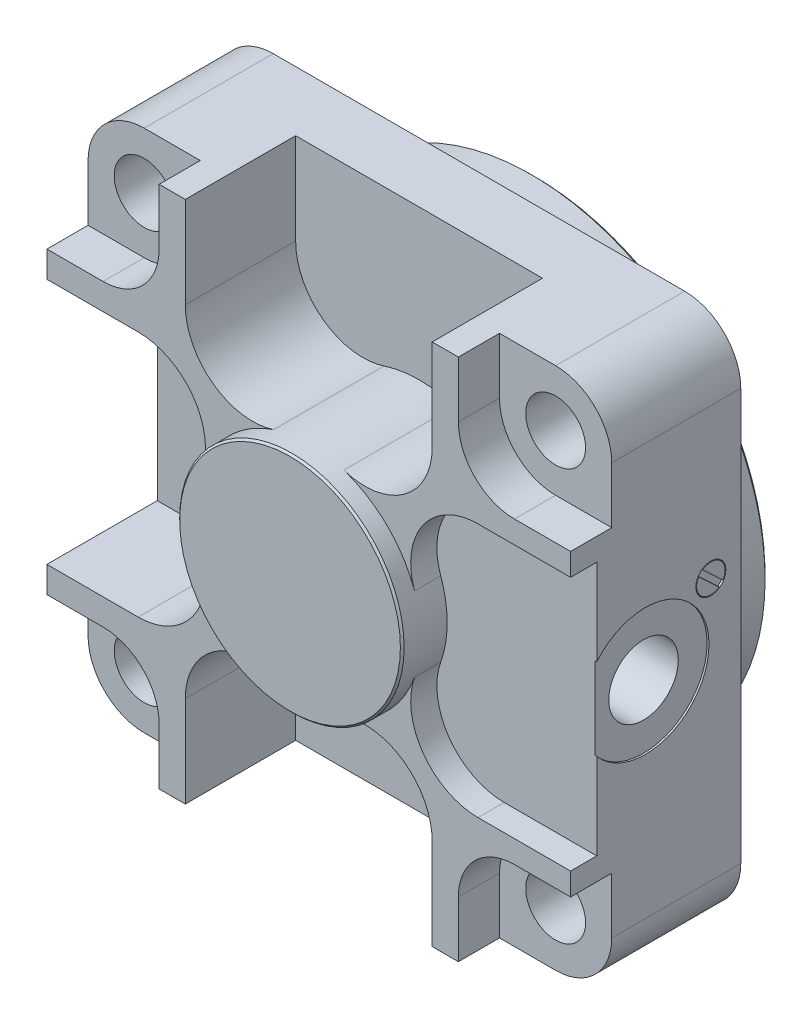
ISO-10303-21;
HEADER;
FILE_DESCRIPTION(('STEP AP214'),'2;1');
FILE_NAME('part.step','',(''),(''),'','','');
FILE_SCHEMA(('AUTOMOTIVE_DESIGN { 1 0 10303 214 1 1 1 1 }'));
ENDSEC;
DATA;
#1=APPLICATION_CONTEXT('core data for automotive mechanical design processes');
#2=APPLICATION_PROTOCOL_DEFINITION('international standard','automotive_design',2000,#1);
#3=PRODUCT_CONTEXT('',#1,'mechanical');
#4=PRODUCT('Part','Part','',(#3));
#5=PRODUCT_RELATED_PRODUCT_CATEGORY('part','',(#4));
#6=PRODUCT_DEFINITION_FORMATION('','',#4);
#7=PRODUCT_DEFINITION_CONTEXT('part definition',#1,'design');
#8=PRODUCT_DEFINITION('design','',#6,#7);
#9=PRODUCT_DEFINITION_SHAPE('','',#8);
#10=(LENGTH_UNIT() NAMED_UNIT(*) SI_UNIT(.MILLI.,.METRE.));
#11=(NAMED_UNIT(*) PLANE_ANGLE_UNIT() SI_UNIT($,.RADIAN.));
#12=(NAMED_UNIT(*) SI_UNIT($,.STERADIAN.) SOLID_ANGLE_UNIT());
#13=UNCERTAINTY_MEASURE_WITH_UNIT(LENGTH_MEASURE(1.E-05),#10,'distance_accuracy_value','');
#14=(GEOMETRIC_REPRESENTATION_CONTEXT(3) GLOBAL_UNCERTAINTY_ASSIGNED_CONTEXT((#13)) GLOBAL_UNIT_ASSIGNED_CONTEXT((#10,
#11,#12)) REPRESENTATION_CONTEXT('',''));
#15=CARTESIAN_POINT('',(0.,0.,0.));
#16=DIRECTION('',(0.,0.,1.));
#17=DIRECTION('',(1.,0.,0.));
#18=AXIS2_PLACEMENT_3D('',#15,#16,#17);
#19=CARTESIAN_POINT('',(-55.,55.,45.5));
#20=DIRECTION('',(0.,0.,1.));
#21=DIRECTION('',(1.,0.,0.));
#22=AXIS2_PLACEMENT_3D('',#19,#20,#21);
#23=PLANE('',#22);
#24=DIRECTION('',(0.,1.,0.));
#25=VECTOR('',#24,1.);
#26=CARTESIAN_POINT('',(33.,45.596052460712,45.5));
#27=LINE('',#26,#25);
#28=CARTESIAN_POINT('',(33.,45.596052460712,45.5));
#29=VERTEX_POINT('',#28);
#30=CARTESIAN_POINT('',(33.,70.,45.5));
#31=VERTEX_POINT('',#30);
#32=EDGE_CURVE('E733',#29,#31,#27,.T.);
#33=ORIENTED_EDGE('',*,*,#32,.F.);
#34=CARTESIAN_POINT('',(15.,45.596052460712,45.5));
#35=DIRECTION('',(0.,0.,1.));
#36=DIRECTION('',(1.,0.,0.));
#37=AXIS2_PLACEMENT_3D('',#34,#35,#36);
#38=CIRCLE('',#37,18.);
#39=CARTESIAN_POINT('',(9.37500000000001,28.497532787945,45.5));
#40=VERTEX_POINT('',#39);
#41=EDGE_CURVE('E736',#40,#29,#38,.T.);
#42=ORIENTED_EDGE('',*,*,#41,.F.);
#43=CARTESIAN_POINT('',(0.,0.,45.5));
#44=DIRECTION('',(0.,0.,1.));
#45=DIRECTION('',(1.,0.,0.));
#46=AXIS2_PLACEMENT_3D('',#43,#44,#45);
#47=CIRCLE('',#46,30.);
#48=CARTESIAN_POINT('',(28.2842712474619,10.,45.5));
#49=VERTEX_POINT('',#48);
#50=EDGE_CURVE('E1218',#49,#40,#47,.T.);
#51=ORIENTED_EDGE('',*,*,#50,.F.);
#52=CARTESIAN_POINT('',(45.254833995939,16.,45.5));
#53=DIRECTION('',(0.,0.,1.));
#54=DIRECTION('',(1.,0.,0.));
#55=AXIS2_PLACEMENT_3D('',#52,#53,#54);
#56=CIRCLE('',#55,18.);
#57=CARTESIAN_POINT('',(45.254833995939,34.,45.5));
#58=VERTEX_POINT('',#57);
#59=EDGE_CURVE('E832',#58,#49,#56,.T.);
#60=ORIENTED_EDGE('',*,*,#59,.F.);
#61=DIRECTION('',(-1.,0.,0.));
#62=VECTOR('',#61,1.);
#63=CARTESIAN_POINT('',(70.,34.,45.5));
#64=LINE('',#63,#62);
#65=CARTESIAN_POINT('',(70.,34.,45.5));
#66=VERTEX_POINT('',#65);
#67=EDGE_CURVE('E829',#66,#58,#64,.T.);
#68=ORIENTED_EDGE('',*,*,#67,.F.);
#69=DIRECTION('',(0.,1.,0.));
#70=VECTOR('',#69,1.);
#71=CARTESIAN_POINT('',(70.,-55.,45.5));
#72=LINE('',#71,#70);
#73=CARTESIAN_POINT('',(70.,40.,45.5));
#74=VERTEX_POINT('',#73);
#75=EDGE_CURVE('E1030',#66,#74,#72,.T.);
#76=ORIENTED_EDGE('',*,*,#75,.T.);
#77=DIRECTION('',(1.,0.,0.));
#78=VECTOR('',#77,1.);
#79=CARTESIAN_POINT('',(55.,40.,45.5));
#80=LINE('',#79,#78);
#81=CARTESIAN_POINT('',(55.,40.,45.5));
#82=VERTEX_POINT('',#81);
#83=EDGE_CURVE('E1282',#82,#74,#80,.T.);
#84=ORIENTED_EDGE('',*,*,#83,.F.);
#85=CARTESIAN_POINT('',(55.,55.,45.5));
#86=DIRECTION('',(0.,0.,1.));
#87=DIRECTION('',(1.,0.,0.));
#88=AXIS2_PLACEMENT_3D('',#85,#86,#87);
#89=CIRCLE('',#88,15.);
#90=CARTESIAN_POINT('',(40.,55.,45.5));
#91=VERTEX_POINT('',#90);
#92=EDGE_CURVE('E1279',#91,#82,#89,.T.);
#93=ORIENTED_EDGE('',*,*,#92,.F.);
#94=DIRECTION('',(0.,-1.,0.));
#95=VECTOR('',#94,1.);
#96=CARTESIAN_POINT('',(40.,55.,45.5));
#97=LINE('',#96,#95);
#98=CARTESIAN_POINT('',(40.,70.,45.5));
#99=VERTEX_POINT('',#98);
#100=EDGE_CURVE('E1135',#99,#91,#97,.T.);
#101=ORIENTED_EDGE('',*,*,#100,.F.);
#102=DIRECTION('',(-1.,0.,0.));
#103=VECTOR('',#102,1.);
#104=CARTESIAN_POINT('',(55.,70.,45.5));
#105=LINE('',#104,#103);
#106=EDGE_CURVE('E1039',#99,#31,#105,.T.);
#107=ORIENTED_EDGE('',*,*,#106,.T.);
#108=EDGE_LOOP('',(#33,#42,#51,#60,#68,#76,#84,#93,#101,#107));
#109=FACE_BOUND('',#108,.T.);
#110=ADVANCED_FACE('F348',(#109),#23,.T.);
#111=DIRECTION('',(0.,-1.,0.));
#112=VECTOR('',#111,1.);
#113=CARTESIAN_POINT('',(-33.,45.596052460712,45.5));
#114=LINE('',#113,#112);
#115=CARTESIAN_POINT('',(-33.,70.,45.5));
#116=VERTEX_POINT('',#115);
#117=CARTESIAN_POINT('',(-33.,45.596052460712,45.5));
#118=VERTEX_POINT('',#117);
#119=EDGE_CURVE('E740',#116,#118,#114,.T.);
#120=ORIENTED_EDGE('',*,*,#119,.F.);
#121=CARTESIAN_POINT('',(-40.,70.,45.5));
#122=VERTEX_POINT('',#121);
#123=EDGE_CURVE('E716',#116,#122,#105,.T.);
#124=ORIENTED_EDGE('',*,*,#123,.T.);
#125=DIRECTION('',(0.,1.,0.));
#126=VECTOR('',#125,1.);
#127=CARTESIAN_POINT('',(-40.,70.,45.5));
#128=LINE('',#127,#126);
#129=CARTESIAN_POINT('',(-40.,55.,45.5));
#130=VERTEX_POINT('',#129);
#131=EDGE_CURVE('E1313',#130,#122,#128,.T.);
#132=ORIENTED_EDGE('',*,*,#131,.F.);
#133=CARTESIAN_POINT('',(-55.,55.,45.5));
#134=DIRECTION('',(0.,0.,1.));
#135=DIRECTION('',(1.,0.,0.));
#136=AXIS2_PLACEMENT_3D('',#133,#134,#135);
#137=CIRCLE('',#136,15.);
#138=CARTESIAN_POINT('',(-55.,40.,45.5));
#139=VERTEX_POINT('',#138);
#140=EDGE_CURVE('E1310',#139,#130,#137,.T.);
#141=ORIENTED_EDGE('',*,*,#140,.F.);
#142=DIRECTION('',(1.,0.,0.));
#143=VECTOR('',#142,1.);
#144=CARTESIAN_POINT('',(-70.,40.,45.5));
#145=LINE('',#144,#143);
#146=CARTESIAN_POINT('',(-70.,40.,45.5));
#147=VERTEX_POINT('',#146);
#148=EDGE_CURVE('E1130',#147,#139,#145,.T.);
#149=ORIENTED_EDGE('',*,*,#148,.F.);
#150=DIRECTION('',(0.,-1.,0.));
#151=VECTOR('',#150,1.);
#152=CARTESIAN_POINT('',(-70.,55.,45.5));
#153=LINE('',#152,#151);
#154=CARTESIAN_POINT('',(-70.,33.,45.5));
#155=VERTEX_POINT('',#154);
#156=EDGE_CURVE('E1027',#147,#155,#153,.T.);
#157=ORIENTED_EDGE('',*,*,#156,.T.);
#158=DIRECTION('',(-1.,0.,0.));
#159=VECTOR('',#158,1.);
#160=CARTESIAN_POINT('',(-70.,33.,45.5));
#161=LINE('',#160,#159);
#162=CARTESIAN_POINT('',(-45.596052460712,33.,45.5));
#163=VERTEX_POINT('',#162);
#164=EDGE_CURVE('E748',#163,#155,#161,.T.);
#165=ORIENTED_EDGE('',*,*,#164,.F.);
#166=CARTESIAN_POINT('',(-45.596052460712,15.,45.5));
#167=DIRECTION('',(0.,0.,1.));
#168=DIRECTION('',(1.,0.,0.));
#169=AXIS2_PLACEMENT_3D('',#166,#167,#168);
#170=CIRCLE('',#169,18.);
#171=CARTESIAN_POINT('',(-28.497532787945,9.37500000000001,45.5));
#172=VERTEX_POINT('',#171);
#173=EDGE_CURVE('E774',#172,#163,#170,.T.);
#174=ORIENTED_EDGE('',*,*,#173,.F.);
#175=CARTESIAN_POINT('',(-9.37500000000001,28.497532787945,45.5));
#176=VERTEX_POINT('',#175);
#177=EDGE_CURVE('E1219',#176,#172,#47,.T.);
#178=ORIENTED_EDGE('',*,*,#177,.F.);
#179=CARTESIAN_POINT('',(-15.,45.596052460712,45.5));
#180=DIRECTION('',(0.,0.,1.));
#181=DIRECTION('',(1.,0.,0.));
#182=AXIS2_PLACEMENT_3D('',#179,#180,#181);
#183=CIRCLE('',#182,18.);
#184=EDGE_CURVE('E363',#118,#176,#183,.T.);
#185=ORIENTED_EDGE('',*,*,#184,.F.);
#186=EDGE_LOOP('',(#120,#124,#132,#141,#149,#157,#165,#174,#178,#185));
#187=FACE_BOUND('',#186,.T.);
#188=ADVANCED_FACE('F971',(#187),#23,.T.);
#189=CARTESIAN_POINT('',(15.,-45.596052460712,45.5));
#190=DIRECTION('',(0.,0.,1.));
#191=DIRECTION('',(1.,0.,0.));
#192=AXIS2_PLACEMENT_3D('',#189,#190,#191);
#193=CIRCLE('',#192,18.);
#194=CARTESIAN_POINT('',(33.,-45.596052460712,45.5));
#195=VERTEX_POINT('',#194);
#196=CARTESIAN_POINT('',(9.37500000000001,-28.497532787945,45.5));
#197=VERTEX_POINT('',#196);
#198=EDGE_CURVE('E777',#195,#197,#193,.T.);
#199=ORIENTED_EDGE('',*,*,#198,.F.);
#200=DIRECTION('',(0.,1.,0.));
#201=VECTOR('',#200,1.);
#202=CARTESIAN_POINT('',(33.,-70.,45.5));
#203=LINE('',#202,#201);
#204=CARTESIAN_POINT('',(33.,-70.,45.5));
#205=VERTEX_POINT('',#204);
#206=EDGE_CURVE('E789',#205,#195,#203,.T.);
#207=ORIENTED_EDGE('',*,*,#206,.F.);
#208=DIRECTION('',(1.,0.,0.));
#209=VECTOR('',#208,1.);
#210=CARTESIAN_POINT('',(-55.,-70.,45.5));
#211=LINE('',#210,#209);
#212=CARTESIAN_POINT('',(40.,-70.,45.5));
#213=VERTEX_POINT('',#212);
#214=EDGE_CURVE('E1021',#205,#213,#211,.T.);
#215=ORIENTED_EDGE('',*,*,#214,.T.);
#216=DIRECTION('',(0.,-1.,0.));
#217=VECTOR('',#216,1.);
#218=CARTESIAN_POINT('',(40.,-70.,45.5));
#219=LINE('',#218,#217);
#220=CARTESIAN_POINT('',(40.,-55.,45.5));
#221=VERTEX_POINT('',#220);
#222=EDGE_CURVE('E1252',#221,#213,#219,.T.);
#223=ORIENTED_EDGE('',*,*,#222,.F.);
#224=CARTESIAN_POINT('',(55.,-55.,45.5));
#225=DIRECTION('',(0.,0.,1.));
#226=DIRECTION('',(1.,0.,0.));
#227=AXIS2_PLACEMENT_3D('',#224,#225,#226);
#228=CIRCLE('',#227,15.);
#229=CARTESIAN_POINT('',(55.,-40.,45.5));
#230=VERTEX_POINT('',#229);
#231=EDGE_CURVE('E1249',#230,#221,#228,.T.);
#232=ORIENTED_EDGE('',*,*,#231,.F.);
#233=DIRECTION('',(-1.,0.,0.));
#234=VECTOR('',#233,1.);
#235=CARTESIAN_POINT('',(55.,-40.,45.5));
#236=LINE('',#235,#234);
#237=CARTESIAN_POINT('',(70.,-40.,45.5));
#238=VERTEX_POINT('',#237);
#239=EDGE_CURVE('E1139',#238,#230,#236,.T.);
#240=ORIENTED_EDGE('',*,*,#239,.F.);
#241=CARTESIAN_POINT('',(70.,-34.,45.5));
#242=VERTEX_POINT('',#241);
#243=EDGE_CURVE('E1036',#238,#242,#72,.T.);
#244=ORIENTED_EDGE('',*,*,#243,.T.);
#245=DIRECTION('',(1.,0.,0.));
#246=VECTOR('',#245,1.);
#247=CARTESIAN_POINT('',(70.,-34.,45.5));
#248=LINE('',#247,#246);
#249=CARTESIAN_POINT('',(45.254833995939,-34.,45.5));
#250=VERTEX_POINT('',#249);
#251=EDGE_CURVE('E827',#250,#242,#248,.T.);
#252=ORIENTED_EDGE('',*,*,#251,.F.);
#253=CARTESIAN_POINT('',(45.254833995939,-16.,45.5));
#254=DIRECTION('',(0.,0.,1.));
#255=DIRECTION('',(1.,0.,0.));
#256=AXIS2_PLACEMENT_3D('',#253,#254,#255);
#257=CIRCLE('',#256,18.);
#258=CARTESIAN_POINT('',(28.2842712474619,-10.,45.5));
#259=VERTEX_POINT('',#258);
#260=EDGE_CURVE('E812',#259,#250,#257,.T.);
#261=ORIENTED_EDGE('',*,*,#260,.F.);
#262=EDGE_CURVE('E1009',#197,#259,#47,.T.);
#263=ORIENTED_EDGE('',*,*,#262,.F.);
#264=EDGE_LOOP('',(#199,#207,#215,#223,#232,#240,#244,#252,#261,#263));
#265=FACE_BOUND('',#264,.T.);
#266=ADVANCED_FACE('F978',(#265),#23,.T.);
#267=CARTESIAN_POINT('',(69.5,0.,25.5));
#268=DIRECTION('',(1.,0.,0.));
#269=DIRECTION('',(0.,1.,0.));
#270=AXIS2_PLACEMENT_3D('',#267,#268,#269);
#271=CYLINDRICAL_SURFACE('',#270,17.);
#272=DIRECTION('',(1.,0.,0.));
#273=VECTOR('',#272,1.);
#274=CARTESIAN_POINT('',(69.5,-10.9544511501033,38.5));
#275=LINE('',#274,#273);
#276=CARTESIAN_POINT('',(70.,-10.9544511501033,38.5));
#277=VERTEX_POINT('',#276);
#278=CARTESIAN_POINT('',(69.5,-10.9544511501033,38.5));
#279=VERTEX_POINT('',#278);
#280=EDGE_CURVE('E869',#277,#279,#275,.F.);
#281=ORIENTED_EDGE('',*,*,#280,.F.);
#282=CARTESIAN_POINT('',(70.,0.,25.5));
#283=DIRECTION('',(1.,0.,0.));
#284=DIRECTION('',(0.,1.,0.));
#285=AXIS2_PLACEMENT_3D('',#282,#283,#284);
#286=CIRCLE('',#285,17.);
#287=CARTESIAN_POINT('',(70.,10.9544511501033,38.5));
#288=VERTEX_POINT('',#287);
#289=EDGE_CURVE('E1496',#277,#288,#286,.T.);
#290=ORIENTED_EDGE('',*,*,#289,.T.);
#291=DIRECTION('',(1.,0.,0.));
#292=VECTOR('',#291,1.);
#293=CARTESIAN_POINT('',(69.5,10.9544511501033,38.5));
#294=LINE('',#293,#292);
#295=CARTESIAN_POINT('',(69.5,10.9544511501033,38.5));
#296=VERTEX_POINT('',#295);
#297=EDGE_CURVE('E857',#296,#288,#294,.T.);
#298=ORIENTED_EDGE('',*,*,#297,.F.);
#299=CARTESIAN_POINT('',(69.5,0.,25.5));
#300=DIRECTION('',(1.,0.,0.));
#301=DIRECTION('',(0.,1.,0.));
#302=AXIS2_PLACEMENT_3D('',#299,#300,#301);
#303=CIRCLE('',#302,17.);
#304=EDGE_CURVE('E1499',#279,#296,#303,.T.);
#305=ORIENTED_EDGE('',*,*,#304,.F.);
#306=EDGE_LOOP('',(#281,#290,#298,#305));
#307=FACE_BOUND('',#306,.T.);
#308=ADVANCED_FACE('F996',(#307),#271,.F.);
#309=CARTESIAN_POINT('',(69.5,0.,25.5));
#310=DIRECTION('',(1.,0.,0.));
#311=DIRECTION('',(0.,1.,0.));
#312=AXIS2_PLACEMENT_3D('',#309,#310,#311);
#313=PLANE('',#312);
#314=CARTESIAN_POINT('',(69.5,0.,25.5));
#315=DIRECTION('',(1.,0.,0.));
#316=DIRECTION('',(0.,1.,0.));
#317=AXIS2_PLACEMENT_3D('',#314,#315,#316);
#318=CIRCLE('',#317,9.3);
#319=CARTESIAN_POINT('',(69.5,9.30000000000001,25.5));
#320=VERTEX_POINT('',#319);
#321=EDGE_CURVE('E871',#320,#320,#318,.T.);
#322=ORIENTED_EDGE('',*,*,#321,.F.);
#323=EDGE_LOOP('',(#322));
#324=FACE_BOUND('',#323,.T.);
#325=ORIENTED_EDGE('',*,*,#304,.T.);
#326=DIRECTION('',(0.,-1.,0.));
#327=VECTOR('',#326,1.);
#328=CARTESIAN_POINT('',(69.5,0.,38.5));
#329=LINE('',#328,#327);
#330=EDGE_CURVE('E1122',#296,#279,#329,.T.);
#331=ORIENTED_EDGE('',*,*,#330,.T.);
#332=EDGE_LOOP('',(#325,#331));
#333=FACE_BOUND('',#332,.T.);
#334=ADVANCED_FACE('F1001',(#324,#333),#313,.T.);
#335=CARTESIAN_POINT('',(69.5,15.,8.));
#336=DIRECTION('',(1.,0.,0.));
#337=DIRECTION('',(0.,1.,0.));
#338=AXIS2_PLACEMENT_3D('',#335,#336,#337);
#339=PLANE('',#338);
#340=DIRECTION('',(0.,-0.681230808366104,-0.732068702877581));
#341=VECTOR('',#340,1.);
#342=CARTESIAN_POINT('',(69.5,18.0868077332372,10.2162170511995));
#343=LINE('',#342,#341);
#344=CARTESIAN_POINT('',(69.5,18.0868077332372,10.2162170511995));
#345=VERTEX_POINT('',#344);
#346=CARTESIAN_POINT('',(69.5,13.0112953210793,4.76193673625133));
#347=VERTEX_POINT('',#346);
#348=EDGE_CURVE('E1477',#345,#347,#343,.T.);
#349=ORIENTED_EDGE('',*,*,#348,.F.);
#350=CARTESIAN_POINT('',(69.5,15.,8.));
#351=DIRECTION('',(1.,0.,0.));
#352=DIRECTION('',(0.,1.,0.));
#353=AXIS2_PLACEMENT_3D('',#350,#351,#352);
#354=CIRCLE('',#353,3.8);
#355=EDGE_CURVE('E1475',#347,#345,#354,.T.);
#356=ORIENTED_EDGE('',*,*,#355,.F.);
#357=EDGE_LOOP('',(#349,#356));
#358=FACE_BOUND('',#357,.T.);
#359=CARTESIAN_POINT('',(69.5,15.,8.));
#360=DIRECTION('',(1.,0.,0.));
#361=DIRECTION('',(0.,1.,0.));
#362=AXIS2_PLACEMENT_3D('',#359,#360,#361);
#363=CIRCLE('',#362,4.);
#364=CARTESIAN_POINT('',(69.5,19.,8.));
#365=VERTEX_POINT('',#364);
#366=EDGE_CURVE('E1490',#365,#365,#363,.T.);
#367=ORIENTED_EDGE('',*,*,#366,.T.);
#368=EDGE_LOOP('',(#367));
#369=FACE_BOUND('',#368,.T.);
#370=DIRECTION('',(0.,0.681230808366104,0.732068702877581));
#371=VECTOR('',#370,1.);
#372=CARTESIAN_POINT('',(69.5,11.9131922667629,5.78378294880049));
#373=LINE('',#372,#371);
#374=CARTESIAN_POINT('',(69.5,11.9131922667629,5.78378294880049));
#375=VERTEX_POINT('',#374);
#376=CARTESIAN_POINT('',(69.5,16.9887046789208,11.2380632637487));
#377=VERTEX_POINT('',#376);
#378=EDGE_CURVE('E1467',#375,#377,#373,.T.);
#379=ORIENTED_EDGE('',*,*,#378,.F.);
#380=CARTESIAN_POINT('',(69.5,15.,8.));
#381=DIRECTION('',(1.,0.,0.));
#382=DIRECTION('',(0.,1.,0.));
#383=AXIS2_PLACEMENT_3D('',#380,#381,#382);
#384=CIRCLE('',#383,3.8);
#385=EDGE_CURVE('E881',#377,#375,#384,.T.);
#386=ORIENTED_EDGE('',*,*,#385,.F.);
#387=EDGE_LOOP('',(#379,#386));
#388=FACE_BOUND('',#387,.T.);
#389=ADVANCED_FACE('F1181',(#358,#369,#388),#339,.T.);
#390=CARTESIAN_POINT('',(-55.,-55.,50.5));
#391=DIRECTION('',(0.,0.,-1.));
#392=DIRECTION('',(-1.,0.,0.));
#393=AXIS2_PLACEMENT_3D('',#390,#391,#392);
#394=CYLINDRICAL_SURFACE('',#393,15.);
#395=CARTESIAN_POINT('',(-55.,-55.,34.5));
#396=DIRECTION('',(0.,0.,1.));
#397=DIRECTION('',(1.,0.,0.));
#398=AXIS2_PLACEMENT_3D('',#395,#396,#397);
#399=CIRCLE('',#398,15.);
#400=CARTESIAN_POINT('',(-70.,-55.,34.5));
#401=VERTEX_POINT('',#400);
#402=CARTESIAN_POINT('',(-55.,-70.,34.5));
#403=VERTEX_POINT('',#402);
#404=EDGE_CURVE('E1520',#401,#403,#399,.T.);
#405=ORIENTED_EDGE('',*,*,#404,.F.);
#406=DIRECTION('',(0.,0.,-1.));
#407=VECTOR('',#406,1.);
#408=CARTESIAN_POINT('',(-70.,-55.,50.5));
#409=LINE('',#408,#407);
#410=CARTESIAN_POINT('',(-70.,-55.,0.));
#411=VERTEX_POINT('',#410);
#412=EDGE_CURVE('E1096',#401,#411,#409,.T.);
#413=ORIENTED_EDGE('',*,*,#412,.T.);
#414=CARTESIAN_POINT('',(-55.,-55.,0.));
#415=DIRECTION('',(0.,0.,1.));
#416=DIRECTION('',(1.,0.,0.));
#417=AXIS2_PLACEMENT_3D('',#414,#415,#416);
#418=CIRCLE('',#417,15.);
#419=CARTESIAN_POINT('',(-55.,-70.,0.));
#420=VERTEX_POINT('',#419);
#421=EDGE_CURVE('E1066',#411,#420,#418,.T.);
#422=ORIENTED_EDGE('',*,*,#421,.T.);
#423=DIRECTION('',(0.,0.,-1.));
#424=VECTOR('',#423,1.);
#425=CARTESIAN_POINT('',(-55.,-70.,50.5));
#426=LINE('',#425,#424);
#427=EDGE_CURVE('E1094',#403,#420,#426,.T.);
#428=ORIENTED_EDGE('',*,*,#427,.F.);
#429=EDGE_LOOP('',(#405,#413,#422,#428));
#430=FACE_BOUND('',#429,.T.);
#431=ADVANCED_FACE('F1179',(#430),#394,.T.);
#432=CARTESIAN_POINT('',(-55.,-55.,50.5));
#433=DIRECTION('',(0.,0.,-1.));
#434=DIRECTION('',(-1.,0.,0.));
#435=AXIS2_PLACEMENT_3D('',#432,#433,#434);
#436=CYLINDRICAL_SURFACE('',#435,8.);
#437=CARTESIAN_POINT('',(-55.,-55.,0.));
#438=DIRECTION('',(0.,0.,1.));
#439=DIRECTION('',(1.,0.,0.));
#440=AXIS2_PLACEMENT_3D('',#437,#438,#439);
#441=CIRCLE('',#440,8.);
#442=CARTESIAN_POINT('',(-47.,-55.,0.));
#443=VERTEX_POINT('',#442);
#444=EDGE_CURVE('E1048',#443,#443,#441,.T.);
#445=ORIENTED_EDGE('',*,*,#444,.F.);
#446=EDGE_LOOP('',(#445));
#447=FACE_BOUND('',#446,.T.);
#448=CARTESIAN_POINT('',(-55.,-55.,34.5));
#449=DIRECTION('',(0.,0.,1.));
#450=DIRECTION('',(1.,0.,0.));
#451=AXIS2_PLACEMENT_3D('',#448,#449,#450);
#452=CIRCLE('',#451,8.);
#453=CARTESIAN_POINT('',(-47.,-55.,34.5));
#454=VERTEX_POINT('',#453);
#455=EDGE_CURVE('E1136',#454,#454,#452,.T.);
#456=ORIENTED_EDGE('',*,*,#455,.T.);
#457=EDGE_LOOP('',(#456));
#458=FACE_BOUND('',#457,.T.);
#459=ADVANCED_FACE('F1174',(#447,#458),#436,.F.);
#460=CARTESIAN_POINT('',(55.,-55.,50.5));
#461=DIRECTION('',(0.,0.,-1.));
#462=DIRECTION('',(-1.,0.,0.));
#463=AXIS2_PLACEMENT_3D('',#460,#461,#462);
#464=CYLINDRICAL_SURFACE('',#463,15.);
#465=CARTESIAN_POINT('',(55.,-55.,34.5));
#466=DIRECTION('',(0.,0.,1.));
#467=DIRECTION('',(1.,0.,0.));
#468=AXIS2_PLACEMENT_3D('',#465,#466,#467);
#469=CIRCLE('',#468,15.);
#470=CARTESIAN_POINT('',(55.,-70.,34.5));
#471=VERTEX_POINT('',#470);
#472=CARTESIAN_POINT('',(70.,-55.,34.5));
#473=VERTEX_POINT('',#472);
#474=EDGE_CURVE('E1256',#471,#473,#469,.T.);
#475=ORIENTED_EDGE('',*,*,#474,.F.);
#476=DIRECTION('',(0.,0.,-1.));
#477=VECTOR('',#476,1.);
#478=CARTESIAN_POINT('',(55.,-70.,50.5));
#479=LINE('',#478,#477);
#480=CARTESIAN_POINT('',(55.,-70.,0.));
#481=VERTEX_POINT('',#480);
#482=EDGE_CURVE('E1092',#471,#481,#479,.T.);
#483=ORIENTED_EDGE('',*,*,#482,.T.);
#484=CARTESIAN_POINT('',(55.,-55.,0.));
#485=DIRECTION('',(0.,0.,1.));
#486=DIRECTION('',(1.,0.,0.));
#487=AXIS2_PLACEMENT_3D('',#484,#485,#486);
#488=CIRCLE('',#487,15.);
#489=CARTESIAN_POINT('',(70.,-55.,0.));
#490=VERTEX_POINT('',#489);
#491=EDGE_CURVE('E1072',#481,#490,#488,.T.);
#492=ORIENTED_EDGE('',*,*,#491,.T.);
#493=DIRECTION('',(0.,0.,-1.));
#494=VECTOR('',#493,1.);
#495=CARTESIAN_POINT('',(70.,-55.,50.5));
#496=LINE('',#495,#494);
#497=EDGE_CURVE('E1090',#473,#490,#496,.T.);
#498=ORIENTED_EDGE('',*,*,#497,.F.);
#499=EDGE_LOOP('',(#475,#483,#492,#498));
#500=FACE_BOUND('',#499,.T.);
#501=ADVANCED_FACE('F1171',(#500),#464,.T.);
#502=CARTESIAN_POINT('',(55.,-55.,50.5));
#503=DIRECTION('',(0.,0.,-1.));
#504=DIRECTION('',(-1.,0.,0.));
#505=AXIS2_PLACEMENT_3D('',#502,#503,#504);
#506=CYLINDRICAL_SURFACE('',#505,8.00000000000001);
#507=CARTESIAN_POINT('',(55.,-55.,0.));
#508=DIRECTION('',(0.,0.,1.));
#509=DIRECTION('',(1.,0.,0.));
#510=AXIS2_PLACEMENT_3D('',#507,#508,#509);
#511=CIRCLE('',#510,8.00000000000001);
#512=CARTESIAN_POINT('',(63.,-55.,0.));
#513=VERTEX_POINT('',#512);
#514=EDGE_CURVE('E1051',#513,#513,#511,.T.);
#515=ORIENTED_EDGE('',*,*,#514,.F.);
#516=EDGE_LOOP('',(#515));
#517=FACE_BOUND('',#516,.T.);
#518=CARTESIAN_POINT('',(55.,-55.,34.5));
#519=DIRECTION('',(0.,0.,1.));
#520=DIRECTION('',(1.,0.,0.));
#521=AXIS2_PLACEMENT_3D('',#518,#519,#520);
#522=CIRCLE('',#521,8.00000000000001);
#523=CARTESIAN_POINT('',(63.,-55.,34.5));
#524=VERTEX_POINT('',#523);
#525=EDGE_CURVE('E1132',#524,#524,#522,.T.);
#526=ORIENTED_EDGE('',*,*,#525,.T.);
#527=EDGE_LOOP('',(#526));
#528=FACE_BOUND('',#527,.T.);
#529=ADVANCED_FACE('F1166',(#517,#528),#506,.F.);
#530=CARTESIAN_POINT('',(55.,55.,50.5));
#531=DIRECTION('',(0.,0.,-1.));
#532=DIRECTION('',(-1.,0.,0.));
#533=AXIS2_PLACEMENT_3D('',#530,#531,#532);
#534=CYLINDRICAL_SURFACE('',#533,15.);
#535=CARTESIAN_POINT('',(55.,55.,34.5));
#536=DIRECTION('',(0.,0.,1.));
#537=DIRECTION('',(1.,0.,0.));
#538=AXIS2_PLACEMENT_3D('',#535,#536,#537);
#539=CIRCLE('',#538,15.);
#540=CARTESIAN_POINT('',(70.,55.,34.5));
#541=VERTEX_POINT('',#540);
#542=CARTESIAN_POINT('',(55.,70.,34.5));
#543=VERTEX_POINT('',#542);
#544=EDGE_CURVE('E1287',#541,#543,#539,.T.);
#545=ORIENTED_EDGE('',*,*,#544,.F.);
#546=DIRECTION('',(0.,0.,-1.));
#547=VECTOR('',#546,1.);
#548=CARTESIAN_POINT('',(70.,55.,50.5));
#549=LINE('',#548,#547);
#550=CARTESIAN_POINT('',(70.,55.,0.));
#551=VERTEX_POINT('',#550);
#552=EDGE_CURVE('E1088',#541,#551,#549,.T.);
#553=ORIENTED_EDGE('',*,*,#552,.T.);
#554=CARTESIAN_POINT('',(55.,55.,0.));
#555=DIRECTION('',(0.,0.,1.));
#556=DIRECTION('',(1.,0.,0.));
#557=AXIS2_PLACEMENT_3D('',#554,#555,#556);
#558=CIRCLE('',#557,15.);
#559=CARTESIAN_POINT('',(55.,70.,0.));
#560=VERTEX_POINT('',#559);
#561=EDGE_CURVE('E1078',#551,#560,#558,.T.);
#562=ORIENTED_EDGE('',*,*,#561,.T.);
#563=DIRECTION('',(0.,0.,-1.));
#564=VECTOR('',#563,1.);
#565=CARTESIAN_POINT('',(55.,70.,50.5));
#566=LINE('',#565,#564);
#567=EDGE_CURVE('E1086',#543,#560,#566,.T.);
#568=ORIENTED_EDGE('',*,*,#567,.F.);
#569=EDGE_LOOP('',(#545,#553,#562,#568));
#570=FACE_BOUND('',#569,.T.);
#571=ADVANCED_FACE('F1162',(#570),#534,.T.);
#572=CARTESIAN_POINT('',(55.,55.,50.5));
#573=DIRECTION('',(0.,0.,-1.));
#574=DIRECTION('',(-1.,0.,0.));
#575=AXIS2_PLACEMENT_3D('',#572,#573,#574);
#576=CYLINDRICAL_SURFACE('',#575,8.00000000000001);
#577=CARTESIAN_POINT('',(55.,55.,0.));
#578=DIRECTION('',(0.,0.,1.));
#579=DIRECTION('',(1.,0.,0.));
#580=AXIS2_PLACEMENT_3D('',#577,#578,#579);
#581=CIRCLE('',#580,8.00000000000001);
#582=CARTESIAN_POINT('',(63.,55.,0.));
#583=VERTEX_POINT('',#582);
#584=EDGE_CURVE('E1054',#583,#583,#581,.T.);
#585=ORIENTED_EDGE('',*,*,#584,.F.);
#586=EDGE_LOOP('',(#585));
#587=FACE_BOUND('',#586,.T.);
#588=CARTESIAN_POINT('',(55.,55.,34.5));
#589=DIRECTION('',(0.,0.,1.));
#590=DIRECTION('',(1.,0.,0.));
#591=AXIS2_PLACEMENT_3D('',#588,#589,#590);
#592=CIRCLE('',#591,8.00000000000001);
#593=CARTESIAN_POINT('',(63.,55.,34.5));
#594=VERTEX_POINT('',#593);
#595=EDGE_CURVE('E1127',#594,#594,#592,.T.);
#596=ORIENTED_EDGE('',*,*,#595,.T.);
#597=EDGE_LOOP('',(#596));
#598=FACE_BOUND('',#597,.T.);
#599=ADVANCED_FACE('F1165',(#587,#598),#576,.F.);
#600=CARTESIAN_POINT('',(-55.,55.,50.5));
#601=DIRECTION('',(0.,0.,-1.));
#602=DIRECTION('',(-1.,0.,0.));
#603=AXIS2_PLACEMENT_3D('',#600,#601,#602);
#604=CYLINDRICAL_SURFACE('',#603,15.);
#605=CARTESIAN_POINT('',(-55.,55.,34.5));
#606=DIRECTION('',(0.,0.,1.));
#607=DIRECTION('',(1.,0.,0.));
#608=AXIS2_PLACEMENT_3D('',#605,#606,#607);
#609=CIRCLE('',#608,15.);
#610=CARTESIAN_POINT('',(-55.,70.,34.5));
#611=VERTEX_POINT('',#610);
#612=CARTESIAN_POINT('',(-70.,55.,34.5));
#613=VERTEX_POINT('',#612);
#614=EDGE_CURVE('E1318',#611,#613,#609,.T.);
#615=ORIENTED_EDGE('',*,*,#614,.F.);
#616=DIRECTION('',(0.,0.,-1.));
#617=VECTOR('',#616,1.);
#618=CARTESIAN_POINT('',(-55.,70.,50.5));
#619=LINE('',#618,#617);
#620=CARTESIAN_POINT('',(-55.,70.,0.));
#621=VERTEX_POINT('',#620);
#622=EDGE_CURVE('E1084',#611,#621,#619,.T.);
#623=ORIENTED_EDGE('',*,*,#622,.T.);
#624=CARTESIAN_POINT('',(-55.,55.,0.));
#625=DIRECTION('',(0.,0.,1.));
#626=DIRECTION('',(1.,0.,0.));
#627=AXIS2_PLACEMENT_3D('',#624,#625,#626);
#628=CIRCLE('',#627,15.);
#629=CARTESIAN_POINT('',(-70.,55.,0.));
#630=VERTEX_POINT('',#629);
#631=EDGE_CURVE('E1060',#621,#630,#628,.T.);
#632=ORIENTED_EDGE('',*,*,#631,.T.);
#633=DIRECTION('',(0.,0.,-1.));
#634=VECTOR('',#633,1.);
#635=CARTESIAN_POINT('',(-70.,55.,50.5));
#636=LINE('',#635,#634);
#637=EDGE_CURVE('E1098',#613,#630,#636,.T.);
#638=ORIENTED_EDGE('',*,*,#637,.F.);
#639=EDGE_LOOP('',(#615,#623,#632,#638));
#640=FACE_BOUND('',#639,.T.);
#641=ADVANCED_FACE('F350',(#640),#604,.T.);
#642=CARTESIAN_POINT('',(-55.,55.,50.5));
#643=DIRECTION('',(0.,0.,-1.));
#644=DIRECTION('',(-1.,0.,0.));
#645=AXIS2_PLACEMENT_3D('',#642,#643,#644);
#646=CYLINDRICAL_SURFACE('',#645,8.);
#647=CARTESIAN_POINT('',(-55.,55.,0.));
#648=DIRECTION('',(0.,0.,1.));
#649=DIRECTION('',(1.,0.,0.));
#650=AXIS2_PLACEMENT_3D('',#647,#648,#649);
#651=CIRCLE('',#650,8.);
#652=CARTESIAN_POINT('',(-47.,55.,0.));
#653=VERTEX_POINT('',#652);
#654=EDGE_CURVE('E1057',#653,#653,#651,.T.);
#655=ORIENTED_EDGE('',*,*,#654,.F.);
#656=EDGE_LOOP('',(#655));
#657=FACE_BOUND('',#656,.T.);
#658=CARTESIAN_POINT('',(-55.,55.,34.5));
#659=DIRECTION('',(0.,0.,1.));
#660=DIRECTION('',(1.,0.,0.));
#661=AXIS2_PLACEMENT_3D('',#658,#659,#660);
#662=CIRCLE('',#661,8.);
#663=CARTESIAN_POINT('',(-47.,55.,34.5));
#664=VERTEX_POINT('',#663);
#665=EDGE_CURVE('E1123',#664,#664,#662,.T.);
#666=ORIENTED_EDGE('',*,*,#665,.T.);
#667=EDGE_LOOP('',(#666));
#668=FACE_BOUND('',#667,.T.);
#669=ADVANCED_FACE('F1184',(#657,#668),#646,.F.);
#670=CARTESIAN_POINT('',(-70.,55.,50.5));
#671=DIRECTION('',(1.,0.,0.));
#672=DIRECTION('',(0.,1.,0.));
#673=AXIS2_PLACEMENT_3D('',#670,#671,#672);
#674=PLANE('',#673);
#675=DIRECTION('',(0.,-1.,0.));
#676=VECTOR('',#675,1.);
#677=CARTESIAN_POINT('',(-70.,33.,16.));
#678=LINE('',#677,#676);
#679=CARTESIAN_POINT('',(-70.,33.,16.));
#680=VERTEX_POINT('',#679);
#681=CARTESIAN_POINT('',(-70.,-33.,16.));
#682=VERTEX_POINT('',#681);
#683=EDGE_CURVE('E749',#680,#682,#678,.T.);
#684=ORIENTED_EDGE('',*,*,#683,.F.);
#685=DIRECTION('',(0.,0.,1.));
#686=VECTOR('',#685,1.);
#687=CARTESIAN_POINT('',(-70.,33.,16.));
#688=LINE('',#687,#686);
#689=EDGE_CURVE('E742',#680,#155,#688,.T.);
#690=ORIENTED_EDGE('',*,*,#689,.T.);
#691=ORIENTED_EDGE('',*,*,#156,.F.);
#692=DIRECTION('',(0.,0.,1.));
#693=VECTOR('',#692,1.);
#694=CARTESIAN_POINT('',(-70.,40.,34.5));
#695=LINE('',#694,#693);
#696=CARTESIAN_POINT('',(-70.,40.,34.5));
#697=VERTEX_POINT('',#696);
#698=EDGE_CURVE('E1204',#697,#147,#695,.T.);
#699=ORIENTED_EDGE('',*,*,#698,.F.);
#700=DIRECTION('',(0.,-1.,0.));
#701=VECTOR('',#700,1.);
#702=CARTESIAN_POINT('',(-70.,55.,34.5));
#703=LINE('',#702,#701);
#704=EDGE_CURVE('E1206',#613,#697,#703,.T.);
#705=ORIENTED_EDGE('',*,*,#704,.F.);
#706=ORIENTED_EDGE('',*,*,#637,.T.);
#707=DIRECTION('',(0.,-1.,0.));
#708=VECTOR('',#707,1.);
#709=CARTESIAN_POINT('',(-70.,55.,0.));
#710=LINE('',#709,#708);
#711=EDGE_CURVE('E1063',#630,#411,#710,.T.);
#712=ORIENTED_EDGE('',*,*,#711,.T.);
#713=ORIENTED_EDGE('',*,*,#412,.F.);
#714=DIRECTION('',(0.,-1.,0.));
#715=VECTOR('',#714,1.);
#716=CARTESIAN_POINT('',(-70.,-40.,34.5));
#717=LINE('',#716,#715);
#718=CARTESIAN_POINT('',(-70.,-40.,34.5));
#719=VERTEX_POINT('',#718);
#720=EDGE_CURVE('E1519',#719,#401,#717,.T.);
#721=ORIENTED_EDGE('',*,*,#720,.F.);
#722=DIRECTION('',(0.,0.,1.));
#723=VECTOR('',#722,1.);
#724=CARTESIAN_POINT('',(-70.,-40.,34.5));
#725=LINE('',#724,#723);
#726=CARTESIAN_POINT('',(-70.,-40.,45.5));
#727=VERTEX_POINT('',#726);
#728=EDGE_CURVE('E1235',#719,#727,#725,.T.);
#729=ORIENTED_EDGE('',*,*,#728,.T.);
#730=CARTESIAN_POINT('',(-70.,-33.,45.5));
#731=VERTEX_POINT('',#730);
#732=EDGE_CURVE('E1032',#731,#727,#153,.T.);
#733=ORIENTED_EDGE('',*,*,#732,.F.);
#734=DIRECTION('',(0.,0.,1.));
#735=VECTOR('',#734,1.);
#736=CARTESIAN_POINT('',(-70.,-33.,16.));
#737=LINE('',#736,#735);
#738=EDGE_CURVE('E746',#682,#731,#737,.T.);
#739=ORIENTED_EDGE('',*,*,#738,.F.);
#740=EDGE_LOOP('',(#684,#690,#691,#699,#705,#706,#712,#713,#721,#729,#733,#739));
#741=FACE_BOUND('',#740,.T.);
#742=ADVANCED_FACE('F1178',(#741),#674,.F.);
#743=CARTESIAN_POINT('',(-55.,-70.,50.5));
#744=DIRECTION('',(0.,1.,0.));
#745=DIRECTION('',(-1.,0.,0.));
#746=AXIS2_PLACEMENT_3D('',#743,#744,#745);
#747=PLANE('',#746);
#748=ORIENTED_EDGE('',*,*,#214,.F.);
#749=DIRECTION('',(0.,0.,1.));
#750=VECTOR('',#749,1.);
#751=CARTESIAN_POINT('',(33.,-70.,16.));
#752=LINE('',#751,#750);
#753=CARTESIAN_POINT('',(33.,-70.,16.));
#754=VERTEX_POINT('',#753);
#755=EDGE_CURVE('E813',#754,#205,#752,.T.);
#756=ORIENTED_EDGE('',*,*,#755,.F.);
#757=DIRECTION('',(1.,0.,0.));
#758=VECTOR('',#757,1.);
#759=CARTESIAN_POINT('',(-33.,-70.,16.));
#760=LINE('',#759,#758);
#761=CARTESIAN_POINT('',(-33.,-70.,16.));
#762=VERTEX_POINT('',#761);
#763=EDGE_CURVE('E804',#762,#754,#760,.T.);
#764=ORIENTED_EDGE('',*,*,#763,.F.);
#765=DIRECTION('',(0.,0.,1.));
#766=VECTOR('',#765,1.);
#767=CARTESIAN_POINT('',(-33.,-70.,16.));
#768=LINE('',#767,#766);
#769=CARTESIAN_POINT('',(-33.,-70.,45.5));
#770=VERTEX_POINT('',#769);
#771=EDGE_CURVE('E815',#762,#770,#768,.T.);
#772=ORIENTED_EDGE('',*,*,#771,.T.);
#773=CARTESIAN_POINT('',(-40.,-70.,45.5));
#774=VERTEX_POINT('',#773);
#775=EDGE_CURVE('E1026',#774,#770,#211,.T.);
#776=ORIENTED_EDGE('',*,*,#775,.F.);
#777=DIRECTION('',(0.,0.,1.));
#778=VECTOR('',#777,1.);
#779=CARTESIAN_POINT('',(-40.,-70.,34.5));
#780=LINE('',#779,#778);
#781=CARTESIAN_POINT('',(-40.,-70.,34.5));
#782=VERTEX_POINT('',#781);
#783=EDGE_CURVE('E1140',#782,#774,#780,.T.);
#784=ORIENTED_EDGE('',*,*,#783,.F.);
#785=DIRECTION('',(1.,0.,0.));
#786=VECTOR('',#785,1.);
#787=CARTESIAN_POINT('',(-55.,-70.,34.5));
#788=LINE('',#787,#786);
#789=EDGE_CURVE('E1232',#403,#782,#788,.T.);
#790=ORIENTED_EDGE('',*,*,#789,.F.);
#791=ORIENTED_EDGE('',*,*,#427,.T.);
#792=DIRECTION('',(1.,0.,0.));
#793=VECTOR('',#792,1.);
#794=CARTESIAN_POINT('',(-55.,-70.,0.));
#795=LINE('',#794,#793);
#796=EDGE_CURVE('E1069',#420,#481,#795,.T.);
#797=ORIENTED_EDGE('',*,*,#796,.T.);
#798=ORIENTED_EDGE('',*,*,#482,.F.);
#799=DIRECTION('',(1.,0.,0.));
#800=VECTOR('',#799,1.);
#801=CARTESIAN_POINT('',(40.,-70.,34.5));
#802=LINE('',#801,#800);
#803=CARTESIAN_POINT('',(40.,-70.,34.5));
#804=VERTEX_POINT('',#803);
#805=EDGE_CURVE('E1254',#804,#471,#802,.T.);
#806=ORIENTED_EDGE('',*,*,#805,.F.);
#807=DIRECTION('',(0.,0.,1.));
#808=VECTOR('',#807,1.);
#809=CARTESIAN_POINT('',(40.,-70.,34.5));
#810=LINE('',#809,#808);
#811=EDGE_CURVE('E1023',#804,#213,#810,.T.);
#812=ORIENTED_EDGE('',*,*,#811,.T.);
#813=EDGE_LOOP('',(#748,#756,#764,#772,#776,#784,#790,#791,#797,#798,#806,#812));
#814=FACE_BOUND('',#813,.T.);
#815=ADVANCED_FACE('F1019',(#814),#747,.F.);
#816=CARTESIAN_POINT('',(70.,55.,50.5));
#817=DIRECTION('',(-1.,0.,0.));
#818=DIRECTION('',(0.,-1.,0.));
#819=AXIS2_PLACEMENT_3D('',#816,#817,#818);
#820=PLANE('',#819);
#821=CARTESIAN_POINT('',(70.,15.,8.));
#822=DIRECTION('',(1.,0.,0.));
#823=DIRECTION('',(0.,1.,0.));
#824=AXIS2_PLACEMENT_3D('',#821,#822,#823);
#825=CIRCLE('',#824,4.);
#826=CARTESIAN_POINT('',(70.,19.,8.));
#827=VERTEX_POINT('',#826);
#828=EDGE_CURVE('E1493',#827,#827,#825,.T.);
#829=ORIENTED_EDGE('',*,*,#828,.F.);
#830=EDGE_LOOP('',(#829));
#831=FACE_BOUND('',#830,.T.);
#832=DIRECTION('',(0.,1.,0.));
#833=VECTOR('',#832,1.);
#834=CARTESIAN_POINT('',(70.,-34.,38.5));
#835=LINE('',#834,#833);
#836=CARTESIAN_POINT('',(70.,-34.,38.5));
#837=VERTEX_POINT('',#836);
#838=EDGE_CURVE('E842',#837,#277,#835,.T.);
#839=ORIENTED_EDGE('',*,*,#838,.F.);
#840=DIRECTION('',(0.,0.,1.));
#841=VECTOR('',#840,1.);
#842=CARTESIAN_POINT('',(70.,-34.,38.5));
#843=LINE('',#842,#841);
#844=EDGE_CURVE('E864',#837,#242,#843,.T.);
#845=ORIENTED_EDGE('',*,*,#844,.T.);
#846=ORIENTED_EDGE('',*,*,#243,.F.);
#847=DIRECTION('',(0.,0.,1.));
#848=VECTOR('',#847,1.);
#849=CARTESIAN_POINT('',(70.,-40.,34.5));
#850=LINE('',#849,#848);
#851=CARTESIAN_POINT('',(70.,-40.,34.5));
#852=VERTEX_POINT('',#851);
#853=EDGE_CURVE('E1270',#852,#238,#850,.T.);
#854=ORIENTED_EDGE('',*,*,#853,.F.);
#855=DIRECTION('',(0.,1.,0.));
#856=VECTOR('',#855,1.);
#857=CARTESIAN_POINT('',(70.,-55.,34.5));
#858=LINE('',#857,#856);
#859=EDGE_CURVE('E1258',#473,#852,#858,.T.);
#860=ORIENTED_EDGE('',*,*,#859,.F.);
#861=ORIENTED_EDGE('',*,*,#497,.T.);
#862=DIRECTION('',(0.,1.,0.));
#863=VECTOR('',#862,1.);
#864=CARTESIAN_POINT('',(70.,55.,0.));
#865=LINE('',#864,#863);
#866=EDGE_CURVE('E1075',#490,#551,#865,.T.);
#867=ORIENTED_EDGE('',*,*,#866,.T.);
#868=ORIENTED_EDGE('',*,*,#552,.F.);
#869=DIRECTION('',(0.,1.,0.));
#870=VECTOR('',#869,1.);
#871=CARTESIAN_POINT('',(70.,40.,34.5));
#872=LINE('',#871,#870);
#873=CARTESIAN_POINT('',(70.,40.,34.5));
#874=VERTEX_POINT('',#873);
#875=EDGE_CURVE('E1285',#874,#541,#872,.T.);
#876=ORIENTED_EDGE('',*,*,#875,.F.);
#877=DIRECTION('',(0.,0.,1.));
#878=VECTOR('',#877,1.);
#879=CARTESIAN_POINT('',(70.,40.,34.5));
#880=LINE('',#879,#878);
#881=EDGE_CURVE('E1131',#874,#74,#880,.T.);
#882=ORIENTED_EDGE('',*,*,#881,.T.);
#883=ORIENTED_EDGE('',*,*,#75,.F.);
#884=DIRECTION('',(0.,0.,1.));
#885=VECTOR('',#884,1.);
#886=CARTESIAN_POINT('',(70.,34.,38.5));
#887=LINE('',#886,#885);
#888=CARTESIAN_POINT('',(70.,34.,38.5));
#889=VERTEX_POINT('',#888);
#890=EDGE_CURVE('E862',#889,#66,#887,.T.);
#891=ORIENTED_EDGE('',*,*,#890,.F.);
#892=EDGE_CURVE('E841',#288,#889,#835,.T.);
#893=ORIENTED_EDGE('',*,*,#892,.F.);
#894=ORIENTED_EDGE('',*,*,#289,.F.);
#895=EDGE_LOOP('',(#839,#845,#846,#854,#860,#861,#867,#868,#876,#882,#883,#891,#893,#894));
#896=FACE_BOUND('',#895,.T.);
#897=ADVANCED_FACE('F1161',(#831,#896),#820,.F.);
#898=CARTESIAN_POINT('',(-55.,70.,50.5));
#899=DIRECTION('',(0.,-1.,0.));
#900=DIRECTION('',(0.,0.,-1.));
#901=AXIS2_PLACEMENT_3D('',#898,#899,#900);
#902=PLANE('',#901);
#903=ORIENTED_EDGE('',*,*,#123,.F.);
#904=DIRECTION('',(0.,0.,1.));
#905=VECTOR('',#904,1.);
#906=CARTESIAN_POINT('',(-33.,70.,16.));
#907=LINE('',#906,#905);
#908=CARTESIAN_POINT('',(-33.,70.,16.));
#909=VERTEX_POINT('',#908);
#910=EDGE_CURVE('E696',#909,#116,#907,.T.);
#911=ORIENTED_EDGE('',*,*,#910,.F.);
#912=DIRECTION('',(-1.,0.,0.));
#913=VECTOR('',#912,1.);
#914=CARTESIAN_POINT('',(33.,70.,16.));
#915=LINE('',#914,#913);
#916=CARTESIAN_POINT('',(33.,70.,16.));
#917=VERTEX_POINT('',#916);
#918=EDGE_CURVE('E705',#917,#909,#915,.T.);
#919=ORIENTED_EDGE('',*,*,#918,.F.);
#920=DIRECTION('',(0.,0.,1.));
#921=VECTOR('',#920,1.);
#922=CARTESIAN_POINT('',(33.,70.,16.));
#923=LINE('',#922,#921);
#924=EDGE_CURVE('E718',#917,#31,#923,.T.);
#925=ORIENTED_EDGE('',*,*,#924,.T.);
#926=ORIENTED_EDGE('',*,*,#106,.F.);
#927=DIRECTION('',(0.,0.,1.));
#928=VECTOR('',#927,1.);
#929=CARTESIAN_POINT('',(40.,70.,34.5));
#930=LINE('',#929,#928);
#931=CARTESIAN_POINT('',(40.,70.,34.5));
#932=VERTEX_POINT('',#931);
#933=EDGE_CURVE('E1301',#932,#99,#930,.T.);
#934=ORIENTED_EDGE('',*,*,#933,.F.);
#935=DIRECTION('',(-1.,0.,0.));
#936=VECTOR('',#935,1.);
#937=CARTESIAN_POINT('',(55.,70.,34.5));
#938=LINE('',#937,#936);
#939=EDGE_CURVE('E1289',#543,#932,#938,.T.);
#940=ORIENTED_EDGE('',*,*,#939,.F.);
#941=ORIENTED_EDGE('',*,*,#567,.T.);
#942=DIRECTION('',(-1.,0.,0.));
#943=VECTOR('',#942,1.);
#944=CARTESIAN_POINT('',(-55.,70.,0.));
#945=LINE('',#944,#943);
#946=EDGE_CURVE('E1081',#560,#621,#945,.T.);
#947=ORIENTED_EDGE('',*,*,#946,.T.);
#948=ORIENTED_EDGE('',*,*,#622,.F.);
#949=DIRECTION('',(-1.,0.,0.));
#950=VECTOR('',#949,1.);
#951=CARTESIAN_POINT('',(-40.,70.,34.5));
#952=LINE('',#951,#950);
#953=CARTESIAN_POINT('',(-40.,70.,34.5));
#954=VERTEX_POINT('',#953);
#955=EDGE_CURVE('E1316',#954,#611,#952,.T.);
#956=ORIENTED_EDGE('',*,*,#955,.F.);
#957=DIRECTION('',(0.,0.,1.));
#958=VECTOR('',#957,1.);
#959=CARTESIAN_POINT('',(-40.,70.,34.5));
#960=LINE('',#959,#958);
#961=EDGE_CURVE('E1126',#954,#122,#960,.T.);
#962=ORIENTED_EDGE('',*,*,#961,.T.);
#963=EDGE_LOOP('',(#903,#911,#919,#925,#926,#934,#940,#941,#947,#948,#956,#962));
#964=FACE_BOUND('',#963,.T.);
#965=ADVANCED_FACE('F714',(#964),#902,.F.);
#966=CARTESIAN_POINT('',(0.,0.,-25.));
#967=DIRECTION('',(0.,0.,1.));
#968=DIRECTION('',(1.,0.,0.));
#969=AXIS2_PLACEMENT_3D('',#966,#967,#968);
#970=CYLINDRICAL_SURFACE('',#969,62.5);
#971=CARTESIAN_POINT('',(0.,0.,-14.));
#972=DIRECTION('',(0.,0.,-1.));
#973=DIRECTION('',(-1.,0.,0.));
#974=AXIS2_PLACEMENT_3D('',#971,#972,#973);
#975=CIRCLE('',#974,62.5);
#976=CARTESIAN_POINT('',(-62.5,0.,-14.));
#977=VERTEX_POINT('',#976);
#978=EDGE_CURVE('E1113',#977,#977,#975,.F.);
#979=ORIENTED_EDGE('',*,*,#978,.T.);
#980=EDGE_LOOP('',(#979));
#981=FACE_BOUND('',#980,.T.);
#982=CARTESIAN_POINT('',(0.,0.,0.));
#983=DIRECTION('',(0.,0.,1.));
#984=DIRECTION('',(1.,0.,0.));
#985=AXIS2_PLACEMENT_3D('',#982,#983,#984);
#986=CIRCLE('',#985,62.5);
#987=CARTESIAN_POINT('',(62.5,0.,0.));
#988=VERTEX_POINT('',#987);
#989=EDGE_CURVE('E1100',#988,#988,#986,.F.);
#990=ORIENTED_EDGE('',*,*,#989,.T.);
#991=EDGE_LOOP('',(#990));
#992=FACE_BOUND('',#991,.T.);
#993=ADVANCED_FACE('F1160',(#981,#992),#970,.T.);
#994=CARTESIAN_POINT('',(-55.,55.,0.));
#995=DIRECTION('',(0.,0.,1.));
#996=DIRECTION('',(1.,0.,0.));
#997=AXIS2_PLACEMENT_3D('',#994,#995,#996);
#998=PLANE('',#997);
#999=ORIENTED_EDGE('',*,*,#444,.T.);
#1000=EDGE_LOOP('',(#999));
#1001=FACE_BOUND('',#1000,.T.);
#1002=ORIENTED_EDGE('',*,*,#584,.T.);
#1003=EDGE_LOOP('',(#1002));
#1004=FACE_BOUND('',#1003,.T.);
#1005=ORIENTED_EDGE('',*,*,#631,.F.);
#1006=ORIENTED_EDGE('',*,*,#946,.F.);
#1007=ORIENTED_EDGE('',*,*,#561,.F.);
#1008=ORIENTED_EDGE('',*,*,#866,.F.);
#1009=ORIENTED_EDGE('',*,*,#491,.F.);
#1010=ORIENTED_EDGE('',*,*,#796,.F.);
#1011=ORIENTED_EDGE('',*,*,#421,.F.);
#1012=ORIENTED_EDGE('',*,*,#711,.F.);
#1013=EDGE_LOOP('',(#1005,#1006,#1007,#1008,#1009,#1010,#1011,#1012));
#1014=FACE_BOUND('',#1013,.T.);
#1015=ORIENTED_EDGE('',*,*,#654,.T.);
#1016=EDGE_LOOP('',(#1015));
#1017=FACE_BOUND('',#1016,.T.);
#1018=ORIENTED_EDGE('',*,*,#514,.T.);
#1019=EDGE_LOOP('',(#1018));
#1020=FACE_BOUND('',#1019,.T.);
#1021=ORIENTED_EDGE('',*,*,#989,.F.);
#1022=EDGE_LOOP('',(#1021));
#1023=FACE_BOUND('',#1022,.T.);
#1024=ADVANCED_FACE('F1156',(#1001,#1004,#1014,#1017,#1020,#1023),#998,.F.);
#1025=CARTESIAN_POINT('',(0.,0.,-15.));
#1026=DIRECTION('',(0.,0.,-1.));
#1027=DIRECTION('',(-1.,0.,0.));
#1028=AXIS2_PLACEMENT_3D('',#1025,#1026,#1027);
#1029=PLANE('',#1028);
#1030=CARTESIAN_POINT('',(0.,0.,-15.));
#1031=DIRECTION('',(0.,0.,-1.));
#1032=DIRECTION('',(-1.,0.,0.));
#1033=AXIS2_PLACEMENT_3D('',#1030,#1031,#1032);
#1034=CIRCLE('',#1033,30.5);
#1035=CARTESIAN_POINT('',(-30.5,0.,-15.));
#1036=VERTEX_POINT('',#1035);
#1037=EDGE_CURVE('E1119',#1036,#1036,#1034,.F.);
#1038=ORIENTED_EDGE('',*,*,#1037,.T.);
#1039=EDGE_LOOP('',(#1038));
#1040=FACE_BOUND('',#1039,.T.);
#1041=CARTESIAN_POINT('',(0.,0.,-15.));
#1042=DIRECTION('',(0.,0.,-1.));
#1043=DIRECTION('',(-1.,0.,0.));
#1044=AXIS2_PLACEMENT_3D('',#1041,#1042,#1043);
#1045=CIRCLE('',#1044,61.5);
#1046=CARTESIAN_POINT('',(-61.5,0.,-15.));
#1047=VERTEX_POINT('',#1046);
#1048=EDGE_CURVE('E1109',#1047,#1047,#1045,.T.);
#1049=ORIENTED_EDGE('',*,*,#1048,.T.);
#1050=EDGE_LOOP('',(#1049));
#1051=FACE_BOUND('',#1050,.T.);
#1052=ADVANCED_FACE('F1764',(#1040,#1051),#1029,.T.);
#1053=CARTESIAN_POINT('',(0.,0.,-15.));
#1054=DIRECTION('',(0.,0.,-1.));
#1055=DIRECTION('',(-1.,0.,0.));
#1056=AXIS2_PLACEMENT_3D('',#1053,#1054,#1055);
#1057=CYLINDRICAL_SURFACE('',#1056,29.5);
#1058=CARTESIAN_POINT('',(0.,0.,-16.));
#1059=DIRECTION('',(0.,0.,-1.));
#1060=DIRECTION('',(-1.,0.,0.));
#1061=AXIS2_PLACEMENT_3D('',#1058,#1059,#1060);
#1062=CIRCLE('',#1061,29.5);
#1063=CARTESIAN_POINT('',(-29.5,0.,-16.));
#1064=VERTEX_POINT('',#1063);
#1065=EDGE_CURVE('E1116',#1064,#1064,#1062,.T.);
#1066=ORIENTED_EDGE('',*,*,#1065,.T.);
#1067=EDGE_LOOP('',(#1066));
#1068=FACE_BOUND('',#1067,.T.);
#1069=CARTESIAN_POINT('',(0.,0.,-24.));
#1070=DIRECTION('',(0.,0.,-1.));
#1071=DIRECTION('',(-1.,0.,0.));
#1072=AXIS2_PLACEMENT_3D('',#1069,#1070,#1071);
#1073=CIRCLE('',#1072,29.5);
#1074=CARTESIAN_POINT('',(-29.5,0.,-24.));
#1075=VERTEX_POINT('',#1074);
#1076=EDGE_CURVE('E1106',#1075,#1075,#1073,.F.);
#1077=ORIENTED_EDGE('',*,*,#1076,.T.);
#1078=EDGE_LOOP('',(#1077));
#1079=FACE_BOUND('',#1078,.T.);
#1080=ADVANCED_FACE('F1762',(#1068,#1079),#1057,.T.);
#1081=CARTESIAN_POINT('',(0.,0.,-25.));
#1082=DIRECTION('',(0.,0.,-1.));
#1083=DIRECTION('',(-1.,0.,0.));
#1084=AXIS2_PLACEMENT_3D('',#1081,#1082,#1083);
#1085=PLANE('',#1084);
#1086=CARTESIAN_POINT('',(0.,0.,-25.));
#1087=DIRECTION('',(0.,0.,-1.));
#1088=DIRECTION('',(-1.,0.,0.));
#1089=AXIS2_PLACEMENT_3D('',#1086,#1087,#1088);
#1090=CIRCLE('',#1089,28.5);
#1091=CARTESIAN_POINT('',(-28.5,0.,-25.));
#1092=VERTEX_POINT('',#1091);
#1093=EDGE_CURVE('E1103',#1092,#1092,#1090,.T.);
#1094=ORIENTED_EDGE('',*,*,#1093,.T.);
#1095=EDGE_LOOP('',(#1094));
#1096=FACE_BOUND('',#1095,.T.);
#1097=CARTESIAN_POINT('',(0.,0.,-25.));
#1098=DIRECTION('',(0.,0.,-1.));
#1099=DIRECTION('',(-1.,0.,0.));
#1100=AXIS2_PLACEMENT_3D('',#1097,#1098,#1099);
#1101=CIRCLE('',#1100,16.);
#1102=CARTESIAN_POINT('',(-16.,0.,-25.));
#1103=VERTEX_POINT('',#1102);
#1104=EDGE_CURVE('E1045',#1103,#1103,#1101,.T.);
#1105=ORIENTED_EDGE('',*,*,#1104,.F.);
#1106=EDGE_LOOP('',(#1105));
#1107=FACE_BOUND('',#1106,.T.);
#1108=ADVANCED_FACE('F1758',(#1096,#1107),#1085,.T.);
#1109=CARTESIAN_POINT('',(0.,0.,-25.));
#1110=DIRECTION('',(0.,0.,-1.));
#1111=DIRECTION('',(-1.,0.,0.));
#1112=AXIS2_PLACEMENT_3D('',#1109,#1110,#1111);
#1113=CYLINDRICAL_SURFACE('',#1112,16.);
#1114=CARTESIAN_POINT('',(13.0196006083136,9.3,25.5));
#1115=CARTESIAN_POINT('',(13.019600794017,9.2999998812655,25.2642770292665));
#1116=CARTESIAN_POINT('',(13.0260259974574,9.2910244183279,25.0285523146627));
#1117=CARTESIAN_POINT('',(13.0514469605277,9.25527990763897,24.5591460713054));
#1118=CARTESIAN_POINT('',(13.0704430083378,9.2285104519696,24.3254645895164));
#1119=CARTESIAN_POINT('',(13.1202286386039,9.15759078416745,23.8618353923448));
#1120=CARTESIAN_POINT('',(13.1510286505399,9.11342520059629,23.6318911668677));
#1121=CARTESIAN_POINT('',(13.2232125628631,9.00836832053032,23.177571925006));
#1122=CARTESIAN_POINT('',(13.2645967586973,8.94747655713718,22.9531970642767));
#1123=CARTESIAN_POINT('',(13.3561491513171,8.81022283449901,22.5128970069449));
#1124=CARTESIAN_POINT('',(13.4062535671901,8.73397261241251,22.2969235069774));
#1125=CARTESIAN_POINT('',(13.5138881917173,8.56648887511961,21.872700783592));
#1126=CARTESIAN_POINT('',(13.5714212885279,8.4752495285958,21.6644546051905));
#1127=CARTESIAN_POINT('',(13.692292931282,8.27855263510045,21.2565533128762));
#1128=CARTESIAN_POINT('',(13.7556316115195,8.17309475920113,21.0568983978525));
#1129=CARTESIAN_POINT('',(13.8865343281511,7.94865025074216,20.6668233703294));
#1130=CARTESIAN_POINT('',(13.9540982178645,7.82966408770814,20.4764029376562));
#1131=CARTESIAN_POINT('',(14.0998079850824,7.56444555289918,20.0841506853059));
#1132=CARTESIAN_POINT('',(14.178281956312,7.41665345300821,19.883493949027));
#1133=CARTESIAN_POINT('',(14.3366185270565,7.10575855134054,19.4949936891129));
#1134=CARTESIAN_POINT('',(14.4164812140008,6.94265478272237,19.3071509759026));
#1135=CARTESIAN_POINT('',(14.5757591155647,6.60171676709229,18.944908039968));
#1136=CARTESIAN_POINT('',(14.6551740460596,6.42387409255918,18.770515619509));
#1137=CARTESIAN_POINT('',(14.8117246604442,6.05418187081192,18.4360758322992));
#1138=CARTESIAN_POINT('',(14.8888599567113,5.86232996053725,18.2760308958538));
#1139=CARTESIAN_POINT('',(15.0466082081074,5.44555179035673,17.9560162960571));
#1140=CARTESIAN_POINT('',(15.1268015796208,5.21923485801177,17.7976438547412));
#1141=CARTESIAN_POINT('',(15.2800903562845,4.75176924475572,17.5007932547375));
#1142=CARTESIAN_POINT('',(15.3531888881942,4.51062717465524,17.3623063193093));
#1143=CARTESIAN_POINT('',(15.4902110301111,4.0149039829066,17.1066526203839));
#1144=CARTESIAN_POINT('',(15.5541382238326,3.76032816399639,16.9894775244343));
#1145=CARTESIAN_POINT('',(15.6709041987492,3.239437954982,16.7779000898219));
#1146=CARTESIAN_POINT('',(15.7237446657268,2.97312535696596,16.6834942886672));
#1147=CARTESIAN_POINT('',(15.8124210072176,2.45558302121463,16.5263459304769));
#1148=CARTESIAN_POINT('',(15.8493651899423,2.20517915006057,16.4615068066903));
#1149=CARTESIAN_POINT('',(15.9116444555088,1.69844305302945,16.352736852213));
#1150=CARTESIAN_POINT('',(15.9369801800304,1.44211115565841,16.308804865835));
#1151=CARTESIAN_POINT('',(15.9752798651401,0.92593844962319,16.2425545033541));
#1152=CARTESIAN_POINT('',(15.9882527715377,0.666100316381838,16.2202204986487));
#1153=CARTESIAN_POINT('',(16.0014622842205,0.145152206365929,16.1974796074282));
#1154=CARTESIAN_POINT('',(16.001700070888,-0.115957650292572,16.1970706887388));
#1155=CARTESIAN_POINT('',(15.9901573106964,-0.606522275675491,16.2169414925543));
#1156=CARTESIAN_POINT('',(15.9797771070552,-0.836112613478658,16.2348106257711));
#1157=CARTESIAN_POINT('',(15.9493339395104,-1.29270578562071,16.2874153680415));
#1158=CARTESIAN_POINT('',(15.9292709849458,-1.51970862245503,16.3221509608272));
#1159=CARTESIAN_POINT('',(15.8799273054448,-1.96954690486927,16.4080626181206));
#1160=CARTESIAN_POINT('',(15.850646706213,-2.19238240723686,16.4592384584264));
#1161=CARTESIAN_POINT('',(15.7835225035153,-2.63248426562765,16.5774472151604));
#1162=CARTESIAN_POINT('',(15.7456785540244,-2.84975039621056,16.6444807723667));
#1163=CARTESIAN_POINT('',(15.6619197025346,-3.27909734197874,16.7942770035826));
#1164=CARTESIAN_POINT('',(15.6159454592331,-3.49112598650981,16.877155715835));
#1165=CARTESIAN_POINT('',(15.5170590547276,-3.9072542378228,17.0575587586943));
#1166=CARTESIAN_POINT('',(15.4641445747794,-4.11135116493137,17.1550879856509));
#1167=CARTESIAN_POINT('',(15.3524368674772,-4.51061544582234,17.3639626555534));
#1168=CARTESIAN_POINT('',(15.2936445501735,-4.70578417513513,17.4753059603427));
#1169=CARTESIAN_POINT('',(15.1712563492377,-5.08655023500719,17.7110863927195));
#1170=CARTESIAN_POINT('',(15.1076587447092,-5.27214409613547,17.8355282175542));
#1171=CARTESIAN_POINT('',(14.9693016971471,-5.65383118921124,18.1117736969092));
#1172=CARTESIAN_POINT('',(14.8940995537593,-5.8486789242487,18.2650782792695));
#1173=CARTESIAN_POINT('',(14.7407954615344,-6.22496996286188,18.586176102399));
#1174=CARTESIAN_POINT('',(14.6626921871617,-6.40640702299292,18.7539760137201));
#1175=CARTESIAN_POINT('',(14.505259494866,-6.75530239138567,19.1033680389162));
#1176=CARTESIAN_POINT('',(14.425928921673,-6.92274644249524,19.284973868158));
#1177=CARTESIAN_POINT('',(14.2679270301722,-7.2427973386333,19.6610902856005));
#1178=CARTESIAN_POINT('',(14.1892557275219,-7.39540383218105,19.8556011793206));
#1179=CARTESIAN_POINT('',(14.0263168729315,-7.70034923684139,20.2779864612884));
#1180=CARTESIAN_POINT('',(13.94233243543,-7.85096760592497,20.5072172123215));
#1181=CARTESIAN_POINT('',(13.780204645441,-8.13217782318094,20.9796832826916));
#1182=CARTESIAN_POINT('',(13.7020621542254,-8.26276672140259,21.2229206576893));
#1183=CARTESIAN_POINT('',(13.5546139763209,-8.5024832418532,21.7218702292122));
#1184=CARTESIAN_POINT('',(13.4852953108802,-8.61164251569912,21.9775633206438));
#1185=CARTESIAN_POINT('',(13.3583108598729,-8.80733586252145,22.5002290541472));
#1186=CARTESIAN_POINT('',(13.3006408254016,-8.89387818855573,22.7671975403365));
#1187=CARTESIAN_POINT('',(13.2116245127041,-9.0253919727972,23.2464070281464));
#1188=CARTESIAN_POINT('',(13.1772773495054,-9.07535367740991,23.4567331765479));
#1189=CARTESIAN_POINT('',(13.118113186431,-9.16066662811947,23.8816328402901));
#1190=CARTESIAN_POINT('',(13.0932942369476,-9.19602086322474,24.0962054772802));
#1191=CARTESIAN_POINT('',(13.0540594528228,-9.25163196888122,24.5280619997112));
#1192=CARTESIAN_POINT('',(13.0396347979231,-9.27190164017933,24.7453434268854));
#1193=CARTESIAN_POINT('',(13.0216811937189,-9.29709964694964,25.181254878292));
#1194=CARTESIAN_POINT('',(13.0181525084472,-9.30202761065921,25.399884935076));
#1195=CARTESIAN_POINT('',(13.0221264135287,-9.29646355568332,25.8370251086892));
#1196=CARTESIAN_POINT('',(13.0296380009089,-9.28595896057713,26.0555349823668));
#1197=CARTESIAN_POINT('',(13.0554273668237,-9.24966524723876,26.4906329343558));
#1198=CARTESIAN_POINT('',(13.0737051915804,-9.22387606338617,26.7072210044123));
#1199=CARTESIAN_POINT('',(13.1203781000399,-9.15736438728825,27.1370714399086));
#1200=CARTESIAN_POINT('',(13.1487776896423,-9.11663524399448,27.3503322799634));
#1201=CARTESIAN_POINT('',(13.2147458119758,-9.02074683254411,27.7722120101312));
#1202=CARTESIAN_POINT('',(13.2523180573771,-8.96558172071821,27.9808289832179));
#1203=CARTESIAN_POINT('',(13.335783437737,-8.84095806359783,28.3938471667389));
#1204=CARTESIAN_POINT('',(13.3817385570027,-8.77139248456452,28.598203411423));
#1205=CARTESIAN_POINT('',(13.480484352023,-8.61886284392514,29.0002069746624));
#1206=CARTESIAN_POINT('',(13.5332772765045,-8.53589437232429,29.1978520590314));
#1207=CARTESIAN_POINT('',(13.6443575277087,-8.35718605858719,29.5857096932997));
#1208=CARTESIAN_POINT('',(13.7026453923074,-8.26144496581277,29.7759215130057));
#1209=CARTESIAN_POINT('',(13.8233696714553,-8.05782262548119,30.1482874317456));
#1210=CARTESIAN_POINT('',(13.8858063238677,-7.94994068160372,30.3304410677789));
#1211=CARTESIAN_POINT('',(14.0993273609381,-7.56980580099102,30.9251672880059));
#1212=CARTESIAN_POINT('',(14.2569983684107,-7.27115139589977,31.3191311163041));
#1213=CARTESIAN_POINT('',(14.4936807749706,-6.77986161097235,31.8705834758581));
#1214=CARTESIAN_POINT('',(14.5726642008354,-6.60873404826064,32.0479381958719));
#1215=CARTESIAN_POINT('',(14.729035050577,-6.25246422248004,32.3889356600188));
#1216=CARTESIAN_POINT('',(14.8064222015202,-6.06731958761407,32.5525760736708));
#1217=CARTESIAN_POINT('',(14.9661971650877,-5.66262729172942,32.8824193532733));
#1218=CARTESIAN_POINT('',(15.0481971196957,-5.44153636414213,33.0469197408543));
#1219=CARTESIAN_POINT('',(15.2058178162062,-4.9841329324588,33.356502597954));
#1220=CARTESIAN_POINT('',(15.2814412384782,-4.74782689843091,33.5015932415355));
#1221=CARTESIAN_POINT('',(15.4241954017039,-4.2612728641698,33.7709640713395));
#1222=CARTESIAN_POINT('',(15.4913288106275,-4.01102927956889,33.8952507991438));
#1223=CARTESIAN_POINT('',(15.6151291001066,-3.49818347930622,34.1215562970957));
#1224=CARTESIAN_POINT('',(15.6717974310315,-3.23558298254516,34.2235781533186));
#1225=CARTESIAN_POINT('',(15.7688888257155,-2.72123740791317,34.3967733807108));
#1226=CARTESIAN_POINT('',(15.8102417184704,-2.47027414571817,34.4697473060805));
#1227=CARTESIAN_POINT('',(15.8813840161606,-1.96152665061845,34.5945584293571));
#1228=CARTESIAN_POINT('',(15.9111739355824,-1.70374272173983,34.6463965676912));
#1229=CARTESIAN_POINT('',(15.9582803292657,-1.18379687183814,34.7280997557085));
#1230=CARTESIAN_POINT('',(15.9756068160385,-0.921638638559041,34.7579824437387));
#1231=CARTESIAN_POINT('',(15.9972866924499,-0.395206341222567,34.7953439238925));
#1232=CARTESIAN_POINT('',(16.0016414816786,-0.130932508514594,34.8028251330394));
#1233=CARTESIAN_POINT('',(15.9975198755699,0.364824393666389,34.7957321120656));
#1234=CARTESIAN_POINT('',(15.9905485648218,0.596362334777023,34.7837450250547));
#1235=CARTESIAN_POINT('',(15.9666910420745,1.05737183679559,34.7425919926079));
#1236=CARTESIAN_POINT('',(15.9498058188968,1.2868436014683,34.7134277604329));
#1237=CARTESIAN_POINT('',(15.9065202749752,1.74209809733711,34.6382891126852));
#1238=CARTESIAN_POINT('',(15.8801198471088,1.96788078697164,34.5923145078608));
#1239=CARTESIAN_POINT('',(15.8184097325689,2.41426737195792,34.4841004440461));
#1240=CARTESIAN_POINT('',(15.7830997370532,2.63487108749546,34.4218604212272));
#1241=CARTESIAN_POINT('',(15.7045168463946,3.06863684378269,34.2820938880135));
#1242=CARTESIAN_POINT('',(15.6612786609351,3.28182668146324,34.2046339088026));
#1243=CARTESIAN_POINT('',(15.5676219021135,3.70070650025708,34.034978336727));
#1244=CARTESIAN_POINT('',(15.5172007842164,3.90639379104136,33.9427775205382));
#1245=CARTESIAN_POINT('',(15.4101951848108,4.30921200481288,33.7444577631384));
#1246=CARTESIAN_POINT('',(15.3536119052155,4.5063445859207,33.6383415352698));
#1247=CARTESIAN_POINT('',(15.2353185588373,4.89138562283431,33.4129097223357));
#1248=CARTESIAN_POINT('',(15.1736066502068,5.07929072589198,33.2935893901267));
#1249=CARTESIAN_POINT('',(15.0392059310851,5.4652056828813,33.0287533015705));
#1250=CARTESIAN_POINT('',(14.9660550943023,5.66206893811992,32.8817998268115));
#1251=CARTESIAN_POINT('',(14.8163857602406,6.04289653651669,32.5734339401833));
#1252=CARTESIAN_POINT('',(14.7398657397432,6.22685494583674,32.4120149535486));
#1253=CARTESIAN_POINT('',(14.5850627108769,6.58128978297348,32.0754395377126));
#1254=CARTESIAN_POINT('',(14.506778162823,6.75175380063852,31.900270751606));
#1255=CARTESIAN_POINT('',(14.3502355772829,7.07838567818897,31.5370618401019));
#1256=CARTESIAN_POINT('',(14.2719775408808,7.23455301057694,31.3490212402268));
#1257=CARTESIAN_POINT('',(14.1085747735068,7.54870120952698,30.9388551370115));
#1258=CARTESIAN_POINT('',(14.0236474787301,7.70490421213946,30.7152763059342));
#1259=CARTESIAN_POINT('',(13.8586908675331,7.99780919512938,30.2539158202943));
#1260=CARTESIAN_POINT('',(13.7786622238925,8.13450850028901,30.0161322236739));
#1261=CARTESIAN_POINT('',(13.6263879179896,8.38709029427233,29.5276826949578));
#1262=CARTESIAN_POINT('',(13.5541342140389,8.50299437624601,29.2770304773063));
#1263=CARTESIAN_POINT('',(13.4202206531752,8.71281752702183,28.7639794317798));
#1264=CARTESIAN_POINT('',(13.3585577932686,8.80674283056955,28.5015839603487));
#1265=CARTESIAN_POINT('',(13.258693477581,8.95620349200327,28.0156926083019));
#1266=CARTESIAN_POINT('',(13.2182639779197,9.01561713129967,27.7938427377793));
#1267=CARTESIAN_POINT('',(13.1477813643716,9.11809878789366,27.3447979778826));
#1268=CARTESIAN_POINT('',(13.1177260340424,9.16117029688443,27.1176042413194));
#1269=CARTESIAN_POINT('',(13.0691637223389,9.23031699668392,26.6596597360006));
#1270=CARTESIAN_POINT('',(13.0506445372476,9.25641014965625,26.4289129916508));
#1271=CARTESIAN_POINT('',(13.0258627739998,9.29125187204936,25.9654447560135));
#1272=CARTESIAN_POINT('',(13.0196004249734,9.30000011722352,25.7327232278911));
#1273=CARTESIAN_POINT('',(13.0196006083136,9.3,25.5));
#1274=B_SPLINE_CURVE_WITH_KNOTS('',3,(#1114,#1115,#1116,#1117,#1118,#1119,#1120,#1121,#1122,
#1123,#1124,#1125,#1126,#1127,#1128,#1129,#1130,#1131,#1132,#1133,#1134,#1135,#1136,#1137,#1138,
#1139,#1140,#1141,#1142,#1143,#1144,#1145,#1146,#1147,#1148,#1149,#1150,#1151,#1152,#1153,#1154,
#1155,#1156,#1157,#1158,#1159,#1160,#1161,#1162,#1163,#1164,#1165,#1166,#1167,#1168,#1169,#1170,
#1171,#1172,#1173,#1174,#1175,#1176,#1177,#1178,#1179,#1180,#1181,#1182,#1183,#1184,#1185,#1186,
#1187,#1188,#1189,#1190,#1191,#1192,#1193,#1194,#1195,#1196,#1197,#1198,#1199,#1200,#1201,#1202,
#1203,#1204,#1205,#1206,#1207,#1208,#1209,#1210,#1211,#1212,#1213,#1214,#1215,#1216,#1217,#1218,
#1219,#1220,#1221,#1222,#1223,#1224,#1225,#1226,#1227,#1228,#1229,#1230,#1231,#1232,#1233,#1234,
#1235,#1236,#1237,#1238,#1239,#1240,#1241,#1242,#1243,#1244,#1245,#1246,#1247,#1248,#1249,#1250,
#1251,#1252,#1253,#1254,#1255,#1256,#1257,#1258,#1259,#1260,#1261,#1262,#1263,#1264,#1265,#1266,
#1267,#1268,#1269,#1270,#1271,#1272,#1273),.UNSPECIFIED.,.T.,.F.,(4,2,2,2,2,2,2,2,2,2,2,2,2,2,2,
2,2,2,2,2,2,2,2,2,2,2,2,2,2,2,2,2,2,2,2,2,2,2,2,2,2,2,2,2,2,2,2,2,2,2,2,2,2,2,2,2,2,2,2,2,2,2,2,
2,2,2,2,2,2,2,2,2,2,2,2,2,2,2,2,4),(0.,0.706917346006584,1.41385089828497,2.12141051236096,
2.82898987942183,3.53159616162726,4.23447643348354,4.93737296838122,5.64024511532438,
6.42327273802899,7.20634983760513,7.98987782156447,8.77353827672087,9.63530165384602,
10.4966835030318,11.3577278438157,12.2186411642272,13.0013903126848,13.7840961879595,
14.566235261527,15.3483018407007,16.0390331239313,16.7297637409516,17.4204849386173,
18.1112340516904,18.8072501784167,19.5034994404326,20.1996410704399,20.8960331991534,
21.6724767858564,22.4492796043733,23.2268644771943,24.0044677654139,24.863958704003,
25.7235761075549,26.5819141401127,27.4399385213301,28.0959339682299,28.7517951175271,
29.407099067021,30.0624188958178,30.7182730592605,31.3741300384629,32.0302793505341,
32.686694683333,33.3481763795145,34.0098761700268,34.6716407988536,35.3334434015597,
36.8828185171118,37.6586839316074,38.4346809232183,39.2961372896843,40.1572297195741,
41.0180508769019,41.878752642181,42.6714448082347,43.4641016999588,44.2561210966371,
45.0480550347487,45.7430703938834,46.4380164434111,47.1329703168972,47.8279482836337,
48.5199532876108,49.2122040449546,49.9043200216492,50.5966856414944,51.3648661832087,
52.1333976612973,52.9026279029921,53.6718865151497,54.5278111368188,55.3838530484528,
56.2390008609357,57.0939057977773,57.7927037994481,58.4913524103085,59.1892606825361,
59.8871820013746),.UNSPECIFIED.);
#1275=CARTESIAN_POINT('',(13.0196006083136,9.3,25.5));
#1276=VERTEX_POINT('',#1275);
#1277=EDGE_CURVE('E874',#1276,#1276,#1274,.T.);
#1278=ORIENTED_EDGE('',*,*,#1277,.F.);
#1279=EDGE_LOOP('',(#1278));
#1280=FACE_BOUND('',#1279,.T.);
#1281=CARTESIAN_POINT('',(0.,0.,35.));
#1282=DIRECTION('',(0.,0.,-1.));
#1283=DIRECTION('',(-1.,0.,0.));
#1284=AXIS2_PLACEMENT_3D('',#1281,#1282,#1283);
#1285=CIRCLE('',#1284,16.);
#1286=CARTESIAN_POINT('',(-16.,0.,35.));
#1287=VERTEX_POINT('',#1286);
#1288=EDGE_CURVE('E1042',#1287,#1287,#1285,.T.);
#1289=ORIENTED_EDGE('',*,*,#1288,.F.);
#1290=EDGE_LOOP('',(#1289));
#1291=FACE_BOUND('',#1290,.T.);
#1292=ORIENTED_EDGE('',*,*,#1104,.T.);
#1293=EDGE_LOOP('',(#1292));
#1294=FACE_BOUND('',#1293,.T.);
#1295=ADVANCED_FACE('F1761',(#1280,#1291,#1294),#1113,.F.);
#1296=CARTESIAN_POINT('',(0.,0.,35.));
#1297=DIRECTION('',(0.,0.,-1.));
#1298=DIRECTION('',(-1.,0.,0.));
#1299=AXIS2_PLACEMENT_3D('',#1296,#1297,#1298);
#1300=CONICAL_SURFACE('',#1299,16.,1.02974425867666);
#1301=CARTESIAN_POINT('',(0.,0.,44.6137699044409));
#1302=VERTEX_POINT('',#1301);
#1303=VERTEX_LOOP('',#1302);
#1304=FACE_BOUND('',#1303,.T.);
#1305=ORIENTED_EDGE('',*,*,#1288,.T.);
#1306=EDGE_LOOP('',(#1305));
#1307=FACE_BOUND('',#1306,.T.);
#1308=ADVANCED_FACE('F1773',(#1304,#1307),#1300,.F.);
#1309=CARTESIAN_POINT('',(0.,0.,-25.));
#1310=DIRECTION('',(0.,0.,1.));
#1311=DIRECTION('',(1.,0.,0.));
#1312=AXIS2_PLACEMENT_3D('',#1309,#1310,#1311);
#1313=CONICAL_SURFACE('',#1312,28.5,0.785398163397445);
#1314=ORIENTED_EDGE('',*,*,#1076,.F.);
#1315=EDGE_LOOP('',(#1314));
#1316=FACE_BOUND('',#1315,.T.);
#1317=ORIENTED_EDGE('',*,*,#1093,.F.);
#1318=EDGE_LOOP('',(#1317));
#1319=FACE_BOUND('',#1318,.T.);
#1320=ADVANCED_FACE('F1777',(#1316,#1319),#1313,.T.);
#1321=CARTESIAN_POINT('',(0.,0.,-15.));
#1322=DIRECTION('',(0.,0.,1.));
#1323=DIRECTION('',(1.,0.,0.));
#1324=AXIS2_PLACEMENT_3D('',#1321,#1322,#1323);
#1325=CONICAL_SURFACE('',#1324,61.5,0.785398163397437);
#1326=ORIENTED_EDGE('',*,*,#978,.F.);
#1327=EDGE_LOOP('',(#1326));
#1328=FACE_BOUND('',#1327,.T.);
#1329=ORIENTED_EDGE('',*,*,#1048,.F.);
#1330=EDGE_LOOP('',(#1329));
#1331=FACE_BOUND('',#1330,.T.);
#1332=ADVANCED_FACE('F993',(#1328,#1331),#1325,.T.);
#1333=CARTESIAN_POINT('',(0.,0.,-16.));
#1334=DIRECTION('',(0.,0.,-1.));
#1335=DIRECTION('',(-1.,0.,0.));
#1336=AXIS2_PLACEMENT_3D('',#1333,#1334,#1335);
#1337=TOROIDAL_SURFACE('',#1336,30.5,1.);
#1338=ORIENTED_EDGE('',*,*,#1037,.F.);
#1339=EDGE_LOOP('',(#1338));
#1340=FACE_BOUND('',#1339,.T.);
#1341=ORIENTED_EDGE('',*,*,#1065,.F.);
#1342=EDGE_LOOP('',(#1341));
#1343=FACE_BOUND('',#1342,.T.);
#1344=ADVANCED_FACE('F985',(#1340,#1343),#1337,.F.);
#1345=CARTESIAN_POINT('',(-45.596052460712,-15.,45.5));
#1346=DIRECTION('',(0.,0.,1.));
#1347=DIRECTION('',(1.,0.,0.));
#1348=AXIS2_PLACEMENT_3D('',#1345,#1346,#1347);
#1349=CIRCLE('',#1348,18.);
#1350=CARTESIAN_POINT('',(-45.596052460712,-33.,45.5));
#1351=VERTEX_POINT('',#1350);
#1352=CARTESIAN_POINT('',(-28.497532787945,-9.37500000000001,45.5));
#1353=VERTEX_POINT('',#1352);
#1354=EDGE_CURVE('E371',#1351,#1353,#1349,.T.);
#1355=ORIENTED_EDGE('',*,*,#1354,.F.);
#1356=DIRECTION('',(1.,0.,0.));
#1357=VECTOR('',#1356,1.);
#1358=CARTESIAN_POINT('',(-70.,-33.,45.5));
#1359=LINE('',#1358,#1357);
#1360=EDGE_CURVE('E779',#731,#1351,#1359,.T.);
#1361=ORIENTED_EDGE('',*,*,#1360,.F.);
#1362=ORIENTED_EDGE('',*,*,#732,.T.);
#1363=DIRECTION('',(-1.,0.,0.));
#1364=VECTOR('',#1363,1.);
#1365=CARTESIAN_POINT('',(-70.,-40.,45.5));
#1366=LINE('',#1365,#1364);
#1367=CARTESIAN_POINT('',(-55.,-40.,45.5));
#1368=VERTEX_POINT('',#1367);
#1369=EDGE_CURVE('E1507',#1368,#727,#1366,.T.);
#1370=ORIENTED_EDGE('',*,*,#1369,.F.);
#1371=CARTESIAN_POINT('',(-55.,-55.,45.5));
#1372=DIRECTION('',(0.,0.,1.));
#1373=DIRECTION('',(1.,0.,0.));
#1374=AXIS2_PLACEMENT_3D('',#1371,#1372,#1373);
#1375=CIRCLE('',#1374,15.);
#1376=CARTESIAN_POINT('',(-40.,-55.,45.5));
#1377=VERTEX_POINT('',#1376);
#1378=EDGE_CURVE('E1504',#1377,#1368,#1375,.T.);
#1379=ORIENTED_EDGE('',*,*,#1378,.F.);
#1380=DIRECTION('',(0.,1.,0.));
#1381=VECTOR('',#1380,1.);
#1382=CARTESIAN_POINT('',(-40.,-55.,45.5));
#1383=LINE('',#1382,#1381);
#1384=EDGE_CURVE('E1502',#774,#1377,#1383,.T.);
#1385=ORIENTED_EDGE('',*,*,#1384,.F.);
#1386=ORIENTED_EDGE('',*,*,#775,.T.);
#1387=DIRECTION('',(0.,-1.,0.));
#1388=VECTOR('',#1387,1.);
#1389=CARTESIAN_POINT('',(-33.,-70.,45.5));
#1390=LINE('',#1389,#1388);
#1391=CARTESIAN_POINT('',(-33.,-45.596052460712,45.5));
#1392=VERTEX_POINT('',#1391);
#1393=EDGE_CURVE('E787',#1392,#770,#1390,.T.);
#1394=ORIENTED_EDGE('',*,*,#1393,.F.);
#1395=CARTESIAN_POINT('',(-15.,-45.596052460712,45.5));
#1396=DIRECTION('',(0.,0.,1.));
#1397=DIRECTION('',(1.,0.,0.));
#1398=AXIS2_PLACEMENT_3D('',#1395,#1396,#1397);
#1399=CIRCLE('',#1398,18.);
#1400=CARTESIAN_POINT('',(-9.37500000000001,-28.497532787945,45.5));
#1401=VERTEX_POINT('',#1400);
#1402=EDGE_CURVE('E784',#1401,#1392,#1399,.T.);
#1403=ORIENTED_EDGE('',*,*,#1402,.F.);
#1404=EDGE_CURVE('E1221',#1353,#1401,#47,.T.);
#1405=ORIENTED_EDGE('',*,*,#1404,.F.);
#1406=EDGE_LOOP('',(#1355,#1361,#1362,#1370,#1379,#1385,#1386,#1394,#1403,#1405));
#1407=FACE_BOUND('',#1406,.T.);
#1408=ADVANCED_FACE('F974',(#1407),#23,.T.);
#1409=CARTESIAN_POINT('',(0.,0.,45.5));
#1410=DIRECTION('',(0.,0.,1.));
#1411=DIRECTION('',(1.,0.,0.));
#1412=AXIS2_PLACEMENT_3D('',#1409,#1410,#1411);
#1413=CYLINDRICAL_SURFACE('',#1412,30.);
#1414=CARTESIAN_POINT('',(0.,0.,50.));
#1415=DIRECTION('',(0.,0.,1.));
#1416=DIRECTION('',(1.,0.,0.));
#1417=AXIS2_PLACEMENT_3D('',#1414,#1415,#1416);
#1418=CIRCLE('',#1417,30.);
#1419=CARTESIAN_POINT('',(30.,0.,50.));
#1420=VERTEX_POINT('',#1419);
#1421=EDGE_CURVE('E11',#1420,#1420,#1418,.F.);
#1422=ORIENTED_EDGE('',*,*,#1421,.T.);
#1423=EDGE_LOOP('',(#1422));
#1424=FACE_BOUND('',#1423,.T.);
#1425=ORIENTED_EDGE('',*,*,#50,.T.);
#1426=DIRECTION('',(0.,0.,1.));
#1427=VECTOR('',#1426,1.);
#1428=CARTESIAN_POINT('',(9.37500000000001,28.497532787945,16.));
#1429=LINE('',#1428,#1427);
#1430=CARTESIAN_POINT('',(9.37500000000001,28.497532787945,16.));
#1431=VERTEX_POINT('',#1430);
#1432=EDGE_CURVE('E729',#1431,#40,#1429,.T.);
#1433=ORIENTED_EDGE('',*,*,#1432,.F.);
#1434=CARTESIAN_POINT('',(0.,0.,16.));
#1435=DIRECTION('',(0.,0.,-1.));
#1436=DIRECTION('',(1.,0.,0.));
#1437=AXIS2_PLACEMENT_3D('',#1434,#1435,#1436);
#1438=CIRCLE('',#1437,30.);
#1439=CARTESIAN_POINT('',(-9.37500000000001,28.497532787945,16.));
#1440=VERTEX_POINT('',#1439);
#1441=EDGE_CURVE('E726',#1440,#1431,#1438,.T.);
#1442=ORIENTED_EDGE('',*,*,#1441,.F.);
#1443=DIRECTION('',(0.,0.,1.));
#1444=VECTOR('',#1443,1.);
#1445=CARTESIAN_POINT('',(-9.37500000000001,28.497532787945,16.));
#1446=LINE('',#1445,#1444);
#1447=EDGE_CURVE('E731',#1440,#176,#1446,.T.);
#1448=ORIENTED_EDGE('',*,*,#1447,.T.);
#1449=ORIENTED_EDGE('',*,*,#177,.T.);
#1450=DIRECTION('',(0.,0.,1.));
#1451=VECTOR('',#1450,1.);
#1452=CARTESIAN_POINT('',(-28.497532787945,9.37500000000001,16.));
#1453=LINE('',#1452,#1451);
#1454=CARTESIAN_POINT('',(-28.497532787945,9.37500000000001,16.));
#1455=VERTEX_POINT('',#1454);
#1456=EDGE_CURVE('E756',#1455,#172,#1453,.T.);
#1457=ORIENTED_EDGE('',*,*,#1456,.F.);
#1458=CARTESIAN_POINT('',(0.,0.,16.));
#1459=DIRECTION('',(0.,0.,-1.));
#1460=DIRECTION('',(1.,0.,0.));
#1461=AXIS2_PLACEMENT_3D('',#1458,#1459,#1460);
#1462=CIRCLE('',#1461,30.);
#1463=CARTESIAN_POINT('',(-28.497532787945,-9.37500000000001,16.));
#1464=VERTEX_POINT('',#1463);
#1465=EDGE_CURVE('E759',#1464,#1455,#1462,.T.);
#1466=ORIENTED_EDGE('',*,*,#1465,.F.);
#1467=DIRECTION('',(0.,0.,1.));
#1468=VECTOR('',#1467,1.);
#1469=CARTESIAN_POINT('',(-28.497532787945,-9.37500000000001,16.));
#1470=LINE('',#1469,#1468);
#1471=EDGE_CURVE('E753',#1464,#1353,#1470,.T.);
#1472=ORIENTED_EDGE('',*,*,#1471,.T.);
#1473=ORIENTED_EDGE('',*,*,#1404,.T.);
#1474=DIRECTION('',(0.,0.,1.));
#1475=VECTOR('',#1474,1.);
#1476=CARTESIAN_POINT('',(-9.37500000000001,-28.497532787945,16.));
#1477=LINE('',#1476,#1475);
#1478=CARTESIAN_POINT('',(-9.37500000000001,-28.497532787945,16.));
#1479=VERTEX_POINT('',#1478);
#1480=EDGE_CURVE('E820',#1479,#1401,#1477,.T.);
#1481=ORIENTED_EDGE('',*,*,#1480,.F.);
#1482=CARTESIAN_POINT('',(0.,0.,16.));
#1483=DIRECTION('',(0.,0.,-1.));
#1484=DIRECTION('',(1.,0.,0.));
#1485=AXIS2_PLACEMENT_3D('',#1482,#1483,#1484);
#1486=CIRCLE('',#1485,30.);
#1487=CARTESIAN_POINT('',(9.375,-28.497532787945,16.));
#1488=VERTEX_POINT('',#1487);
#1489=EDGE_CURVE('E795',#1488,#1479,#1486,.T.);
#1490=ORIENTED_EDGE('',*,*,#1489,.F.);
#1491=DIRECTION('',(0.,0.,1.));
#1492=VECTOR('',#1491,1.);
#1493=CARTESIAN_POINT('',(9.375,-28.497532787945,16.));
#1494=LINE('',#1493,#1492);
#1495=EDGE_CURVE('E809',#1488,#197,#1494,.T.);
#1496=ORIENTED_EDGE('',*,*,#1495,.T.);
#1497=ORIENTED_EDGE('',*,*,#262,.T.);
#1498=DIRECTION('',(0.,0.,1.));
#1499=VECTOR('',#1498,1.);
#1500=CARTESIAN_POINT('',(28.2842712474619,-10.,38.5));
#1501=LINE('',#1500,#1499);
#1502=CARTESIAN_POINT('',(28.2842712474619,-10.,38.5));
#1503=VERTEX_POINT('',#1502);
#1504=EDGE_CURVE('E854',#1503,#259,#1501,.T.);
#1505=ORIENTED_EDGE('',*,*,#1504,.F.);
#1506=CARTESIAN_POINT('',(0.,0.,38.5));
#1507=DIRECTION('',(0.,0.,-1.));
#1508=DIRECTION('',(1.,0.,0.));
#1509=AXIS2_PLACEMENT_3D('',#1506,#1507,#1508);
#1510=CIRCLE('',#1509,30.);
#1511=CARTESIAN_POINT('',(28.2842712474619,10.,38.5));
#1512=VERTEX_POINT('',#1511);
#1513=EDGE_CURVE('E850',#1512,#1503,#1510,.T.);
#1514=ORIENTED_EDGE('',*,*,#1513,.F.);
#1515=DIRECTION('',(0.,0.,1.));
#1516=VECTOR('',#1515,1.);
#1517=CARTESIAN_POINT('',(28.2842712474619,10.,38.5));
#1518=LINE('',#1517,#1516);
#1519=EDGE_CURVE('E858',#1512,#49,#1518,.T.);
#1520=ORIENTED_EDGE('',*,*,#1519,.T.);
#1521=EDGE_LOOP('',(#1425,#1433,#1442,#1448,#1449,#1457,#1466,#1472,#1473,#1481,#1490,#1496,
#1497,#1505,#1514,#1520));
#1522=FACE_BOUND('',#1521,.T.);
#1523=ADVANCED_FACE('F984',(#1424,#1522),#1413,.T.);
#1524=CARTESIAN_POINT('',(-55.,55.,50.5));
#1525=DIRECTION('',(0.,0.,1.));
#1526=DIRECTION('',(1.,0.,0.));
#1527=AXIS2_PLACEMENT_3D('',#1524,#1525,#1526);
#1528=PLANE('',#1527);
#1529=CARTESIAN_POINT('',(0.,0.,50.5));
#1530=DIRECTION('',(0.,0.,1.));
#1531=DIRECTION('',(1.,0.,0.));
#1532=AXIS2_PLACEMENT_3D('',#1529,#1530,#1531);
#1533=CIRCLE('',#1532,29.5);
#1534=CARTESIAN_POINT('',(29.5,0.,50.5));
#1535=VERTEX_POINT('',#1534);
#1536=EDGE_CURVE('E356',#1535,#1535,#1533,.T.);
#1537=ORIENTED_EDGE('',*,*,#1536,.T.);
#1538=EDGE_LOOP('',(#1537));
#1539=FACE_BOUND('',#1538,.T.);
#1540=ADVANCED_FACE('F991',(#1539),#1528,.T.);
#1541=CARTESIAN_POINT('',(-40.,70.,34.5));
#1542=DIRECTION('',(1.,0.,0.));
#1543=DIRECTION('',(0.,1.,0.));
#1544=AXIS2_PLACEMENT_3D('',#1541,#1542,#1543);
#1545=PLANE('',#1544);
#1546=ORIENTED_EDGE('',*,*,#131,.T.);
#1547=ORIENTED_EDGE('',*,*,#961,.F.);
#1548=DIRECTION('',(0.,1.,0.));
#1549=VECTOR('',#1548,1.);
#1550=CARTESIAN_POINT('',(-40.,70.,34.5));
#1551=LINE('',#1550,#1549);
#1552=CARTESIAN_POINT('',(-40.,55.,34.5));
#1553=VERTEX_POINT('',#1552);
#1554=EDGE_CURVE('E1210',#1553,#954,#1551,.T.);
#1555=ORIENTED_EDGE('',*,*,#1554,.F.);
#1556=DIRECTION('',(0.,0.,1.));
#1557=VECTOR('',#1556,1.);
#1558=CARTESIAN_POINT('',(-40.,55.,34.5));
#1559=LINE('',#1558,#1557);
#1560=EDGE_CURVE('E1212',#1553,#130,#1559,.T.);
#1561=ORIENTED_EDGE('',*,*,#1560,.T.);
#1562=EDGE_LOOP('',(#1546,#1547,#1555,#1561));
#1563=FACE_BOUND('',#1562,.T.);
#1564=ADVANCED_FACE('F1146',(#1563),#1545,.F.);
#1565=CARTESIAN_POINT('',(-55.,55.,34.5));
#1566=DIRECTION('',(0.,0.,1.));
#1567=DIRECTION('',(1.,0.,0.));
#1568=AXIS2_PLACEMENT_3D('',#1565,#1566,#1567);
#1569=CYLINDRICAL_SURFACE('',#1568,15.);
#1570=ORIENTED_EDGE('',*,*,#140,.T.);
#1571=ORIENTED_EDGE('',*,*,#1560,.F.);
#1572=CARTESIAN_POINT('',(-55.,55.,34.5));
#1573=DIRECTION('',(0.,0.,1.));
#1574=DIRECTION('',(1.,0.,0.));
#1575=AXIS2_PLACEMENT_3D('',#1572,#1573,#1574);
#1576=CIRCLE('',#1575,15.);
#1577=CARTESIAN_POINT('',(-55.,40.,34.5));
#1578=VERTEX_POINT('',#1577);
#1579=EDGE_CURVE('E1215',#1578,#1553,#1576,.T.);
#1580=ORIENTED_EDGE('',*,*,#1579,.F.);
#1581=DIRECTION('',(0.,0.,1.));
#1582=VECTOR('',#1581,1.);
#1583=CARTESIAN_POINT('',(-55.,40.,34.5));
#1584=LINE('',#1583,#1582);
#1585=EDGE_CURVE('E1209',#1578,#139,#1584,.T.);
#1586=ORIENTED_EDGE('',*,*,#1585,.T.);
#1587=EDGE_LOOP('',(#1570,#1571,#1580,#1586));
#1588=FACE_BOUND('',#1587,.T.);
#1589=ADVANCED_FACE('F1151',(#1588),#1569,.F.);
#1590=CARTESIAN_POINT('',(-70.,40.,34.5));
#1591=DIRECTION('',(0.,-1.,0.));
#1592=DIRECTION('',(0.,0.,-1.));
#1593=AXIS2_PLACEMENT_3D('',#1590,#1591,#1592);
#1594=PLANE('',#1593);
#1595=ORIENTED_EDGE('',*,*,#148,.T.);
#1596=ORIENTED_EDGE('',*,*,#1585,.F.);
#1597=DIRECTION('',(1.,0.,0.));
#1598=VECTOR('',#1597,1.);
#1599=CARTESIAN_POINT('',(-70.,40.,34.5));
#1600=LINE('',#1599,#1598);
#1601=EDGE_CURVE('E1321',#697,#1578,#1600,.T.);
#1602=ORIENTED_EDGE('',*,*,#1601,.F.);
#1603=ORIENTED_EDGE('',*,*,#698,.T.);
#1604=EDGE_LOOP('',(#1595,#1596,#1602,#1603));
#1605=FACE_BOUND('',#1604,.T.);
#1606=ADVANCED_FACE('F1368',(#1605),#1594,.F.);
#1607=CARTESIAN_POINT('',(-55.,55.,34.5));
#1608=DIRECTION('',(0.,0.,1.));
#1609=DIRECTION('',(1.,0.,0.));
#1610=AXIS2_PLACEMENT_3D('',#1607,#1608,#1609);
#1611=PLANE('',#1610);
#1612=ORIENTED_EDGE('',*,*,#665,.F.);
#1613=EDGE_LOOP('',(#1612));
#1614=FACE_BOUND('',#1613,.T.);
#1615=ORIENTED_EDGE('',*,*,#955,.T.);
#1616=ORIENTED_EDGE('',*,*,#614,.T.);
#1617=ORIENTED_EDGE('',*,*,#704,.T.);
#1618=ORIENTED_EDGE('',*,*,#1601,.T.);
#1619=ORIENTED_EDGE('',*,*,#1579,.T.);
#1620=ORIENTED_EDGE('',*,*,#1554,.T.);
#1621=EDGE_LOOP('',(#1615,#1616,#1617,#1618,#1619,#1620));
#1622=FACE_BOUND('',#1621,.T.);
#1623=ADVANCED_FACE('F1367',(#1614,#1622),#1611,.T.);
#1624=CARTESIAN_POINT('',(55.,40.,34.5));
#1625=DIRECTION('',(0.,-1.,0.));
#1626=DIRECTION('',(0.,0.,-1.));
#1627=AXIS2_PLACEMENT_3D('',#1624,#1625,#1626);
#1628=PLANE('',#1627);
#1629=ORIENTED_EDGE('',*,*,#83,.T.);
#1630=ORIENTED_EDGE('',*,*,#881,.F.);
#1631=DIRECTION('',(1.,0.,0.));
#1632=VECTOR('',#1631,1.);
#1633=CARTESIAN_POINT('',(55.,40.,34.5));
#1634=LINE('',#1633,#1632);
#1635=CARTESIAN_POINT('',(55.,40.,34.5));
#1636=VERTEX_POINT('',#1635);
#1637=EDGE_CURVE('E1298',#1636,#874,#1634,.T.);
#1638=ORIENTED_EDGE('',*,*,#1637,.F.);
#1639=DIRECTION('',(0.,0.,1.));
#1640=VECTOR('',#1639,1.);
#1641=CARTESIAN_POINT('',(55.,40.,34.5));
#1642=LINE('',#1641,#1640);
#1643=EDGE_CURVE('E1304',#1636,#82,#1642,.T.);
#1644=ORIENTED_EDGE('',*,*,#1643,.T.);
#1645=EDGE_LOOP('',(#1629,#1630,#1638,#1644));
#1646=FACE_BOUND('',#1645,.T.);
#1647=ADVANCED_FACE('F1375',(#1646),#1628,.F.);
#1648=CARTESIAN_POINT('',(55.,55.,34.5));
#1649=DIRECTION('',(0.,0.,1.));
#1650=DIRECTION('',(1.,0.,0.));
#1651=AXIS2_PLACEMENT_3D('',#1648,#1649,#1650);
#1652=CYLINDRICAL_SURFACE('',#1651,15.);
#1653=ORIENTED_EDGE('',*,*,#92,.T.);
#1654=ORIENTED_EDGE('',*,*,#1643,.F.);
#1655=CARTESIAN_POINT('',(55.,55.,34.5));
#1656=DIRECTION('',(0.,0.,1.));
#1657=DIRECTION('',(1.,0.,0.));
#1658=AXIS2_PLACEMENT_3D('',#1655,#1656,#1657);
#1659=CIRCLE('',#1658,15.);
#1660=CARTESIAN_POINT('',(40.,55.,34.5));
#1661=VERTEX_POINT('',#1660);
#1662=EDGE_CURVE('E1295',#1661,#1636,#1659,.T.);
#1663=ORIENTED_EDGE('',*,*,#1662,.F.);
#1664=DIRECTION('',(0.,0.,1.));
#1665=VECTOR('',#1664,1.);
#1666=CARTESIAN_POINT('',(40.,55.,34.5));
#1667=LINE('',#1666,#1665);
#1668=EDGE_CURVE('E1306',#1661,#91,#1667,.T.);
#1669=ORIENTED_EDGE('',*,*,#1668,.T.);
#1670=EDGE_LOOP('',(#1653,#1654,#1663,#1669));
#1671=FACE_BOUND('',#1670,.T.);
#1672=ADVANCED_FACE('F1382',(#1671),#1652,.F.);
#1673=CARTESIAN_POINT('',(40.,55.,34.5));
#1674=DIRECTION('',(-1.,0.,0.));
#1675=DIRECTION('',(0.,0.,1.));
#1676=AXIS2_PLACEMENT_3D('',#1673,#1674,#1675);
#1677=PLANE('',#1676);
#1678=ORIENTED_EDGE('',*,*,#100,.T.);
#1679=ORIENTED_EDGE('',*,*,#1668,.F.);
#1680=DIRECTION('',(0.,-1.,0.));
#1681=VECTOR('',#1680,1.);
#1682=CARTESIAN_POINT('',(40.,55.,34.5));
#1683=LINE('',#1682,#1681);
#1684=EDGE_CURVE('E1292',#932,#1661,#1683,.T.);
#1685=ORIENTED_EDGE('',*,*,#1684,.F.);
#1686=ORIENTED_EDGE('',*,*,#933,.T.);
#1687=EDGE_LOOP('',(#1678,#1679,#1685,#1686));
#1688=FACE_BOUND('',#1687,.T.);
#1689=ADVANCED_FACE('F1343',(#1688),#1677,.F.);
#1690=CARTESIAN_POINT('',(55.,55.,34.5));
#1691=DIRECTION('',(0.,0.,1.));
#1692=DIRECTION('',(1.,0.,0.));
#1693=AXIS2_PLACEMENT_3D('',#1690,#1691,#1692);
#1694=PLANE('',#1693);
#1695=ORIENTED_EDGE('',*,*,#595,.F.);
#1696=EDGE_LOOP('',(#1695));
#1697=FACE_BOUND('',#1696,.T.);
#1698=ORIENTED_EDGE('',*,*,#875,.T.);
#1699=ORIENTED_EDGE('',*,*,#544,.T.);
#1700=ORIENTED_EDGE('',*,*,#939,.T.);
#1701=ORIENTED_EDGE('',*,*,#1684,.T.);
#1702=ORIENTED_EDGE('',*,*,#1662,.T.);
#1703=ORIENTED_EDGE('',*,*,#1637,.T.);
#1704=EDGE_LOOP('',(#1698,#1699,#1700,#1701,#1702,#1703));
#1705=FACE_BOUND('',#1704,.T.);
#1706=ADVANCED_FACE('F1346',(#1697,#1705),#1694,.T.);
#1707=CARTESIAN_POINT('',(40.,-70.,34.5));
#1708=DIRECTION('',(-1.,0.,0.));
#1709=DIRECTION('',(0.,-1.,0.));
#1710=AXIS2_PLACEMENT_3D('',#1707,#1708,#1709);
#1711=PLANE('',#1710);
#1712=ORIENTED_EDGE('',*,*,#222,.T.);
#1713=ORIENTED_EDGE('',*,*,#811,.F.);
#1714=DIRECTION('',(0.,-1.,0.));
#1715=VECTOR('',#1714,1.);
#1716=CARTESIAN_POINT('',(40.,-70.,34.5));
#1717=LINE('',#1716,#1715);
#1718=CARTESIAN_POINT('',(40.,-55.,34.5));
#1719=VERTEX_POINT('',#1718);
#1720=EDGE_CURVE('E1267',#1719,#804,#1717,.T.);
#1721=ORIENTED_EDGE('',*,*,#1720,.F.);
#1722=DIRECTION('',(0.,0.,1.));
#1723=VECTOR('',#1722,1.);
#1724=CARTESIAN_POINT('',(40.,-55.,34.5));
#1725=LINE('',#1724,#1723);
#1726=EDGE_CURVE('E1272',#1719,#221,#1725,.T.);
#1727=ORIENTED_EDGE('',*,*,#1726,.T.);
#1728=EDGE_LOOP('',(#1712,#1713,#1721,#1727));
#1729=FACE_BOUND('',#1728,.T.);
#1730=ADVANCED_FACE('F1391',(#1729),#1711,.F.);
#1731=CARTESIAN_POINT('',(55.,-55.,34.5));
#1732=DIRECTION('',(0.,0.,1.));
#1733=DIRECTION('',(1.,0.,0.));
#1734=AXIS2_PLACEMENT_3D('',#1731,#1732,#1733);
#1735=CYLINDRICAL_SURFACE('',#1734,15.);
#1736=ORIENTED_EDGE('',*,*,#231,.T.);
#1737=ORIENTED_EDGE('',*,*,#1726,.F.);
#1738=CARTESIAN_POINT('',(55.,-55.,34.5));
#1739=DIRECTION('',(0.,0.,1.));
#1740=DIRECTION('',(1.,0.,0.));
#1741=AXIS2_PLACEMENT_3D('',#1738,#1739,#1740);
#1742=CIRCLE('',#1741,15.);
#1743=CARTESIAN_POINT('',(55.,-40.,34.5));
#1744=VERTEX_POINT('',#1743);
#1745=EDGE_CURVE('E1264',#1744,#1719,#1742,.T.);
#1746=ORIENTED_EDGE('',*,*,#1745,.F.);
#1747=DIRECTION('',(0.,0.,1.));
#1748=VECTOR('',#1747,1.);
#1749=CARTESIAN_POINT('',(55.,-40.,34.5));
#1750=LINE('',#1749,#1748);
#1751=EDGE_CURVE('E1274',#1744,#230,#1750,.T.);
#1752=ORIENTED_EDGE('',*,*,#1751,.T.);
#1753=EDGE_LOOP('',(#1736,#1737,#1746,#1752));
#1754=FACE_BOUND('',#1753,.T.);
#1755=ADVANCED_FACE('F1397',(#1754),#1735,.F.);
#1756=CARTESIAN_POINT('',(55.,-40.,34.5));
#1757=DIRECTION('',(0.,1.,0.));
#1758=DIRECTION('',(0.,0.,1.));
#1759=AXIS2_PLACEMENT_3D('',#1756,#1757,#1758);
#1760=PLANE('',#1759);
#1761=ORIENTED_EDGE('',*,*,#239,.T.);
#1762=ORIENTED_EDGE('',*,*,#1751,.F.);
#1763=DIRECTION('',(-1.,0.,0.));
#1764=VECTOR('',#1763,1.);
#1765=CARTESIAN_POINT('',(55.,-40.,34.5));
#1766=LINE('',#1765,#1764);
#1767=EDGE_CURVE('E1261',#852,#1744,#1766,.T.);
#1768=ORIENTED_EDGE('',*,*,#1767,.F.);
#1769=ORIENTED_EDGE('',*,*,#853,.T.);
#1770=EDGE_LOOP('',(#1761,#1762,#1768,#1769));
#1771=FACE_BOUND('',#1770,.T.);
#1772=ADVANCED_FACE('F1393',(#1771),#1760,.F.);
#1773=CARTESIAN_POINT('',(55.,-55.,34.5));
#1774=DIRECTION('',(0.,0.,1.));
#1775=DIRECTION('',(1.,0.,0.));
#1776=AXIS2_PLACEMENT_3D('',#1773,#1774,#1775);
#1777=PLANE('',#1776);
#1778=ORIENTED_EDGE('',*,*,#525,.F.);
#1779=EDGE_LOOP('',(#1778));
#1780=FACE_BOUND('',#1779,.T.);
#1781=ORIENTED_EDGE('',*,*,#805,.T.);
#1782=ORIENTED_EDGE('',*,*,#474,.T.);
#1783=ORIENTED_EDGE('',*,*,#859,.T.);
#1784=ORIENTED_EDGE('',*,*,#1767,.T.);
#1785=ORIENTED_EDGE('',*,*,#1745,.T.);
#1786=ORIENTED_EDGE('',*,*,#1720,.T.);
#1787=EDGE_LOOP('',(#1781,#1782,#1783,#1784,#1785,#1786));
#1788=FACE_BOUND('',#1787,.T.);
#1789=ADVANCED_FACE('F1396',(#1780,#1788),#1777,.T.);
#1790=CARTESIAN_POINT('',(-40.,-55.,34.5));
#1791=DIRECTION('',(1.,0.,0.));
#1792=DIRECTION('',(0.,1.,0.));
#1793=AXIS2_PLACEMENT_3D('',#1790,#1791,#1792);
#1794=PLANE('',#1793);
#1795=ORIENTED_EDGE('',*,*,#1384,.T.);
#1796=DIRECTION('',(0.,0.,1.));
#1797=VECTOR('',#1796,1.);
#1798=CARTESIAN_POINT('',(-40.,-55.,34.5));
#1799=LINE('',#1798,#1797);
#1800=CARTESIAN_POINT('',(-40.,-55.,34.5));
#1801=VERTEX_POINT('',#1800);
#1802=EDGE_CURVE('E1244',#1801,#1377,#1799,.T.);
#1803=ORIENTED_EDGE('',*,*,#1802,.F.);
#1804=DIRECTION('',(0.,1.,0.));
#1805=VECTOR('',#1804,1.);
#1806=CARTESIAN_POINT('',(-40.,-55.,34.5));
#1807=LINE('',#1806,#1805);
#1808=EDGE_CURVE('E1510',#782,#1801,#1807,.T.);
#1809=ORIENTED_EDGE('',*,*,#1808,.F.);
#1810=ORIENTED_EDGE('',*,*,#783,.T.);
#1811=EDGE_LOOP('',(#1795,#1803,#1809,#1810));
#1812=FACE_BOUND('',#1811,.T.);
#1813=ADVANCED_FACE('F1407',(#1812),#1794,.F.);
#1814=CARTESIAN_POINT('',(-70.,-40.,34.5));
#1815=DIRECTION('',(0.,1.,0.));
#1816=DIRECTION('',(0.,0.,1.));
#1817=AXIS2_PLACEMENT_3D('',#1814,#1815,#1816);
#1818=PLANE('',#1817);
#1819=ORIENTED_EDGE('',*,*,#1369,.T.);
#1820=ORIENTED_EDGE('',*,*,#728,.F.);
#1821=DIRECTION('',(-1.,0.,0.));
#1822=VECTOR('',#1821,1.);
#1823=CARTESIAN_POINT('',(-70.,-40.,34.5));
#1824=LINE('',#1823,#1822);
#1825=CARTESIAN_POINT('',(-55.,-40.,34.5));
#1826=VERTEX_POINT('',#1825);
#1827=EDGE_CURVE('E1516',#1826,#719,#1824,.T.);
#1828=ORIENTED_EDGE('',*,*,#1827,.F.);
#1829=DIRECTION('',(0.,0.,1.));
#1830=VECTOR('',#1829,1.);
#1831=CARTESIAN_POINT('',(-55.,-40.,34.5));
#1832=LINE('',#1831,#1830);
#1833=EDGE_CURVE('E1238',#1826,#1368,#1832,.T.);
#1834=ORIENTED_EDGE('',*,*,#1833,.T.);
#1835=EDGE_LOOP('',(#1819,#1820,#1828,#1834));
#1836=FACE_BOUND('',#1835,.T.);
#1837=ADVANCED_FACE('F1411',(#1836),#1818,.F.);
#1838=CARTESIAN_POINT('',(-55.,-55.,34.5));
#1839=DIRECTION('',(0.,0.,1.));
#1840=DIRECTION('',(1.,0.,0.));
#1841=AXIS2_PLACEMENT_3D('',#1838,#1839,#1840);
#1842=CYLINDRICAL_SURFACE('',#1841,15.);
#1843=ORIENTED_EDGE('',*,*,#1378,.T.);
#1844=ORIENTED_EDGE('',*,*,#1833,.F.);
#1845=CARTESIAN_POINT('',(-55.,-55.,34.5));
#1846=DIRECTION('',(0.,0.,1.));
#1847=DIRECTION('',(1.,0.,0.));
#1848=AXIS2_PLACEMENT_3D('',#1845,#1846,#1847);
#1849=CIRCLE('',#1848,15.);
#1850=EDGE_CURVE('E1513',#1801,#1826,#1849,.T.);
#1851=ORIENTED_EDGE('',*,*,#1850,.F.);
#1852=ORIENTED_EDGE('',*,*,#1802,.T.);
#1853=EDGE_LOOP('',(#1843,#1844,#1851,#1852));
#1854=FACE_BOUND('',#1853,.T.);
#1855=ADVANCED_FACE('F1412',(#1854),#1842,.F.);
#1856=CARTESIAN_POINT('',(-55.,-55.,34.5));
#1857=DIRECTION('',(0.,0.,1.));
#1858=DIRECTION('',(1.,0.,0.));
#1859=AXIS2_PLACEMENT_3D('',#1856,#1857,#1858);
#1860=PLANE('',#1859);
#1861=ORIENTED_EDGE('',*,*,#455,.F.);
#1862=EDGE_LOOP('',(#1861));
#1863=FACE_BOUND('',#1862,.T.);
#1864=ORIENTED_EDGE('',*,*,#1808,.T.);
#1865=ORIENTED_EDGE('',*,*,#1850,.T.);
#1866=ORIENTED_EDGE('',*,*,#1827,.T.);
#1867=ORIENTED_EDGE('',*,*,#720,.T.);
#1868=ORIENTED_EDGE('',*,*,#404,.T.);
#1869=ORIENTED_EDGE('',*,*,#789,.T.);
#1870=EDGE_LOOP('',(#1864,#1865,#1866,#1867,#1868,#1869));
#1871=FACE_BOUND('',#1870,.T.);
#1872=ADVANCED_FACE('F1415',(#1863,#1871),#1860,.T.);
#1873=CARTESIAN_POINT('',(69.5,15.,8.));
#1874=DIRECTION('',(1.,0.,0.));
#1875=DIRECTION('',(0.,1.,0.));
#1876=AXIS2_PLACEMENT_3D('',#1873,#1874,#1875);
#1877=CYLINDRICAL_SURFACE('',#1876,4.);
#1878=ORIENTED_EDGE('',*,*,#366,.F.);
#1879=EDGE_LOOP('',(#1878));
#1880=FACE_BOUND('',#1879,.T.);
#1881=ORIENTED_EDGE('',*,*,#828,.T.);
#1882=EDGE_LOOP('',(#1881));
#1883=FACE_BOUND('',#1882,.T.);
#1884=ADVANCED_FACE('F1421',(#1880,#1883),#1877,.F.);
#1885=CARTESIAN_POINT('',(70.,15.,8.));
#1886=DIRECTION('',(-1.,0.,0.));
#1887=DIRECTION('',(0.,-1.,0.));
#1888=AXIS2_PLACEMENT_3D('',#1885,#1886,#1887);
#1889=CYLINDRICAL_SURFACE('',#1888,3.8);
#1890=ORIENTED_EDGE('',*,*,#355,.T.);
#1891=DIRECTION('',(-1.,0.,0.));
#1892=VECTOR('',#1891,1.);
#1893=CARTESIAN_POINT('',(70.,18.0868077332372,10.2162170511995));
#1894=LINE('',#1893,#1892);
#1895=CARTESIAN_POINT('',(70.,18.0868077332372,10.2162170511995));
#1896=VERTEX_POINT('',#1895);
#1897=EDGE_CURVE('E1487',#1896,#345,#1894,.T.);
#1898=ORIENTED_EDGE('',*,*,#1897,.F.);
#1899=CARTESIAN_POINT('',(70.,15.,8.));
#1900=DIRECTION('',(1.,0.,0.));
#1901=DIRECTION('',(0.,1.,0.));
#1902=AXIS2_PLACEMENT_3D('',#1899,#1900,#1901);
#1903=CIRCLE('',#1902,3.8);
#1904=CARTESIAN_POINT('',(70.,13.0112953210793,4.76193673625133));
#1905=VERTEX_POINT('',#1904);
#1906=EDGE_CURVE('E1479',#1905,#1896,#1903,.T.);
#1907=ORIENTED_EDGE('',*,*,#1906,.F.);
#1908=DIRECTION('',(-1.,0.,0.));
#1909=VECTOR('',#1908,1.);
#1910=CARTESIAN_POINT('',(70.,13.0112953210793,4.76193673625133));
#1911=LINE('',#1910,#1909);
#1912=EDGE_CURVE('E1484',#1905,#347,#1911,.T.);
#1913=ORIENTED_EDGE('',*,*,#1912,.T.);
#1914=EDGE_LOOP('',(#1890,#1898,#1907,#1913));
#1915=FACE_BOUND('',#1914,.T.);
#1916=ADVANCED_FACE('F1432',(#1915),#1889,.T.);
#1917=CARTESIAN_POINT('',(70.,18.0868077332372,10.2162170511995));
#1918=DIRECTION('',(0.,0.732068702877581,-0.681230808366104));
#1919=DIRECTION('',(0.,0.681230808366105,0.732068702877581));
#1920=AXIS2_PLACEMENT_3D('',#1917,#1918,#1919);
#1921=PLANE('',#1920);
#1922=ORIENTED_EDGE('',*,*,#348,.T.);
#1923=ORIENTED_EDGE('',*,*,#1912,.F.);
#1924=DIRECTION('',(0.,-0.681230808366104,-0.732068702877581));
#1925=VECTOR('',#1924,1.);
#1926=CARTESIAN_POINT('',(70.,18.0868077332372,10.2162170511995));
#1927=LINE('',#1926,#1925);
#1928=EDGE_CURVE('E1482',#1896,#1905,#1927,.T.);
#1929=ORIENTED_EDGE('',*,*,#1928,.F.);
#1930=ORIENTED_EDGE('',*,*,#1897,.T.);
#1931=EDGE_LOOP('',(#1922,#1923,#1929,#1930));
#1932=FACE_BOUND('',#1931,.T.);
#1933=ADVANCED_FACE('F1436',(#1932),#1921,.F.);
#1934=CARTESIAN_POINT('',(70.,15.,8.));
#1935=DIRECTION('',(1.,0.,0.));
#1936=DIRECTION('',(0.,1.,0.));
#1937=AXIS2_PLACEMENT_3D('',#1934,#1935,#1936);
#1938=PLANE('',#1937);
#1939=ORIENTED_EDGE('',*,*,#1906,.T.);
#1940=ORIENTED_EDGE('',*,*,#1928,.T.);
#1941=EDGE_LOOP('',(#1939,#1940));
#1942=FACE_BOUND('',#1941,.T.);
#1943=ADVANCED_FACE('F1440',(#1942),#1938,.T.);
#1944=CARTESIAN_POINT('',(70.,15.,8.));
#1945=DIRECTION('',(-1.,0.,0.));
#1946=DIRECTION('',(0.,-1.,0.));
#1947=AXIS2_PLACEMENT_3D('',#1944,#1945,#1946);
#1948=CYLINDRICAL_SURFACE('',#1947,3.8);
#1949=ORIENTED_EDGE('',*,*,#385,.T.);
#1950=DIRECTION('',(-1.,0.,0.));
#1951=VECTOR('',#1950,1.);
#1952=CARTESIAN_POINT('',(70.,11.9131922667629,5.78378294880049));
#1953=LINE('',#1952,#1951);
#1954=CARTESIAN_POINT('',(70.,11.9131922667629,5.78378294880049));
#1955=VERTEX_POINT('',#1954);
#1956=EDGE_CURVE('E882',#1955,#375,#1953,.T.);
#1957=ORIENTED_EDGE('',*,*,#1956,.F.);
#1958=CARTESIAN_POINT('',(70.,15.,8.));
#1959=DIRECTION('',(1.,0.,0.));
#1960=DIRECTION('',(0.,1.,0.));
#1961=AXIS2_PLACEMENT_3D('',#1958,#1959,#1960);
#1962=CIRCLE('',#1961,3.8);
#1963=CARTESIAN_POINT('',(70.,16.9887046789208,11.2380632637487));
#1964=VERTEX_POINT('',#1963);
#1965=EDGE_CURVE('E1470',#1964,#1955,#1962,.T.);
#1966=ORIENTED_EDGE('',*,*,#1965,.F.);
#1967=DIRECTION('',(-1.,0.,0.));
#1968=VECTOR('',#1967,1.);
#1969=CARTESIAN_POINT('',(70.,16.9887046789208,11.2380632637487));
#1970=LINE('',#1969,#1968);
#1971=EDGE_CURVE('E1463',#1964,#377,#1970,.T.);
#1972=ORIENTED_EDGE('',*,*,#1971,.T.);
#1973=EDGE_LOOP('',(#1949,#1957,#1966,#1972));
#1974=FACE_BOUND('',#1973,.T.);
#1975=ADVANCED_FACE('F1444',(#1974),#1948,.T.);
#1976=CARTESIAN_POINT('',(70.,11.9131922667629,5.78378294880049));
#1977=DIRECTION('',(0.,-0.732068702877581,0.681230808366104));
#1978=DIRECTION('',(0.,-0.681230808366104,-0.732068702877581));
#1979=AXIS2_PLACEMENT_3D('',#1976,#1977,#1978);
#1980=PLANE('',#1979);
#1981=ORIENTED_EDGE('',*,*,#378,.T.);
#1982=ORIENTED_EDGE('',*,*,#1971,.F.);
#1983=DIRECTION('',(0.,0.681230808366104,0.732068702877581));
#1984=VECTOR('',#1983,1.);
#1985=CARTESIAN_POINT('',(70.,11.9131922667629,5.78378294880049));
#1986=LINE('',#1985,#1984);
#1987=EDGE_CURVE('E1468',#1955,#1964,#1986,.T.);
#1988=ORIENTED_EDGE('',*,*,#1987,.F.);
#1989=ORIENTED_EDGE('',*,*,#1956,.T.);
#1990=EDGE_LOOP('',(#1981,#1982,#1988,#1989));
#1991=FACE_BOUND('',#1990,.T.);
#1992=ADVANCED_FACE('F1449',(#1991),#1980,.F.);
#1993=CARTESIAN_POINT('',(70.,15.,8.));
#1994=DIRECTION('',(1.,0.,0.));
#1995=DIRECTION('',(0.,1.,0.));
#1996=AXIS2_PLACEMENT_3D('',#1993,#1994,#1995);
#1997=PLANE('',#1996);
#1998=ORIENTED_EDGE('',*,*,#1965,.T.);
#1999=ORIENTED_EDGE('',*,*,#1987,.T.);
#2000=EDGE_LOOP('',(#1998,#1999));
#2001=FACE_BOUND('',#2000,.T.);
#2002=ADVANCED_FACE('F1446',(#2001),#1997,.T.);
#2003=CARTESIAN_POINT('',(-70.001,0.,25.5));
#2004=DIRECTION('',(1.,0.,0.));
#2005=DIRECTION('',(0.,1.,0.));
#2006=AXIS2_PLACEMENT_3D('',#2003,#2004,#2005);
#2007=CYLINDRICAL_SURFACE('',#2006,9.3);
#2008=ORIENTED_EDGE('',*,*,#1277,.T.);
#2009=EDGE_LOOP('',(#2008));
#2010=FACE_BOUND('',#2009,.T.);
#2011=ORIENTED_EDGE('',*,*,#321,.T.);
#2012=EDGE_LOOP('',(#2011));
#2013=FACE_BOUND('',#2012,.T.);
#2014=ADVANCED_FACE('F884',(#2010,#2013),#2007,.F.);
#2015=CARTESIAN_POINT('',(45.254833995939,-16.,38.5));
#2016=DIRECTION('',(0.,0.,1.));
#2017=DIRECTION('',(1.,0.,0.));
#2018=AXIS2_PLACEMENT_3D('',#2015,#2016,#2017);
#2019=PLANE('',#2018);
#2020=ORIENTED_EDGE('',*,*,#280,.T.);
#2021=ORIENTED_EDGE('',*,*,#330,.F.);
#2022=ORIENTED_EDGE('',*,*,#297,.T.);
#2023=ORIENTED_EDGE('',*,*,#892,.T.);
#2024=DIRECTION('',(-1.,0.,0.));
#2025=VECTOR('',#2024,1.);
#2026=CARTESIAN_POINT('',(70.,34.,38.5));
#2027=LINE('',#2026,#2025);
#2028=CARTESIAN_POINT('',(45.254833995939,34.,38.5));
#2029=VERTEX_POINT('',#2028);
#2030=EDGE_CURVE('E844',#889,#2029,#2027,.T.);
#2031=ORIENTED_EDGE('',*,*,#2030,.T.);
#2032=CARTESIAN_POINT('',(45.254833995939,16.,38.5));
#2033=DIRECTION('',(0.,0.,1.));
#2034=DIRECTION('',(1.,0.,0.));
#2035=AXIS2_PLACEMENT_3D('',#2032,#2033,#2034);
#2036=CIRCLE('',#2035,18.);
#2037=EDGE_CURVE('E847',#2029,#1512,#2036,.T.);
#2038=ORIENTED_EDGE('',*,*,#2037,.T.);
#2039=ORIENTED_EDGE('',*,*,#1513,.T.);
#2040=CARTESIAN_POINT('',(45.254833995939,-16.,38.5));
#2041=DIRECTION('',(0.,0.,1.));
#2042=DIRECTION('',(1.,0.,0.));
#2043=AXIS2_PLACEMENT_3D('',#2040,#2041,#2042);
#2044=CIRCLE('',#2043,18.);
#2045=CARTESIAN_POINT('',(45.254833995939,-34.,38.5));
#2046=VERTEX_POINT('',#2045);
#2047=EDGE_CURVE('E835',#1503,#2046,#2044,.T.);
#2048=ORIENTED_EDGE('',*,*,#2047,.T.);
#2049=DIRECTION('',(1.,0.,0.));
#2050=VECTOR('',#2049,1.);
#2051=CARTESIAN_POINT('',(70.,-34.,38.5));
#2052=LINE('',#2051,#2050);
#2053=EDGE_CURVE('E838',#2046,#837,#2052,.T.);
#2054=ORIENTED_EDGE('',*,*,#2053,.T.);
#2055=ORIENTED_EDGE('',*,*,#838,.T.);
#2056=EDGE_LOOP('',(#2020,#2021,#2022,#2023,#2031,#2038,#2039,#2048,#2054,#2055));
#2057=FACE_BOUND('',#2056,.T.);
#2058=ADVANCED_FACE('F893',(#2057),#2019,.T.);
#2059=CARTESIAN_POINT('',(45.254833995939,-16.,38.5));
#2060=DIRECTION('',(0.,0.,1.));
#2061=DIRECTION('',(1.,0.,0.));
#2062=AXIS2_PLACEMENT_3D('',#2059,#2060,#2061);
#2063=CYLINDRICAL_SURFACE('',#2062,18.);
#2064=ORIENTED_EDGE('',*,*,#260,.T.);
#2065=DIRECTION('',(0.,0.,1.));
#2066=VECTOR('',#2065,1.);
#2067=CARTESIAN_POINT('',(45.254833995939,-34.,38.5));
#2068=LINE('',#2067,#2066);
#2069=EDGE_CURVE('E853',#2046,#250,#2068,.T.);
#2070=ORIENTED_EDGE('',*,*,#2069,.F.);
#2071=ORIENTED_EDGE('',*,*,#2047,.F.);
#2072=ORIENTED_EDGE('',*,*,#1504,.T.);
#2073=EDGE_LOOP('',(#2064,#2070,#2071,#2072));
#2074=FACE_BOUND('',#2073,.T.);
#2075=ADVANCED_FACE('F889',(#2074),#2063,.F.);
#2076=CARTESIAN_POINT('',(45.254833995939,16.,38.5));
#2077=DIRECTION('',(0.,0.,1.));
#2078=DIRECTION('',(1.,0.,0.));
#2079=AXIS2_PLACEMENT_3D('',#2076,#2077,#2078);
#2080=CYLINDRICAL_SURFACE('',#2079,18.);
#2081=ORIENTED_EDGE('',*,*,#59,.T.);
#2082=ORIENTED_EDGE('',*,*,#1519,.F.);
#2083=ORIENTED_EDGE('',*,*,#2037,.F.);
#2084=DIRECTION('',(0.,0.,1.));
#2085=VECTOR('',#2084,1.);
#2086=CARTESIAN_POINT('',(45.254833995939,34.,38.5));
#2087=LINE('',#2086,#2085);
#2088=EDGE_CURVE('E860',#2029,#58,#2087,.T.);
#2089=ORIENTED_EDGE('',*,*,#2088,.T.);
#2090=EDGE_LOOP('',(#2081,#2082,#2083,#2089));
#2091=FACE_BOUND('',#2090,.T.);
#2092=ADVANCED_FACE('F892',(#2091),#2080,.F.);
#2093=CARTESIAN_POINT('',(70.,34.,38.5));
#2094=DIRECTION('',(0.,1.,0.));
#2095=DIRECTION('',(-1.,0.,0.));
#2096=AXIS2_PLACEMENT_3D('',#2093,#2094,#2095);
#2097=PLANE('',#2096);
#2098=ORIENTED_EDGE('',*,*,#67,.T.);
#2099=ORIENTED_EDGE('',*,*,#2088,.F.);
#2100=ORIENTED_EDGE('',*,*,#2030,.F.);
#2101=ORIENTED_EDGE('',*,*,#890,.T.);
#2102=EDGE_LOOP('',(#2098,#2099,#2100,#2101));
#2103=FACE_BOUND('',#2102,.T.);
#2104=ADVANCED_FACE('F899',(#2103),#2097,.F.);
#2105=CARTESIAN_POINT('',(70.,-34.,38.5));
#2106=DIRECTION('',(0.,-1.,0.));
#2107=DIRECTION('',(1.,0.,0.));
#2108=AXIS2_PLACEMENT_3D('',#2105,#2106,#2107);
#2109=PLANE('',#2108);
#2110=ORIENTED_EDGE('',*,*,#251,.T.);
#2111=ORIENTED_EDGE('',*,*,#844,.F.);
#2112=ORIENTED_EDGE('',*,*,#2053,.F.);
#2113=ORIENTED_EDGE('',*,*,#2069,.T.);
#2114=EDGE_LOOP('',(#2110,#2111,#2112,#2113));
#2115=FACE_BOUND('',#2114,.T.);
#2116=ADVANCED_FACE('F895',(#2115),#2109,.F.);
#2117=CARTESIAN_POINT('',(15.,-45.596052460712,16.));
#2118=DIRECTION('',(0.,0.,1.));
#2119=DIRECTION('',(1.,0.,0.));
#2120=AXIS2_PLACEMENT_3D('',#2117,#2118,#2119);
#2121=CYLINDRICAL_SURFACE('',#2120,18.);
#2122=ORIENTED_EDGE('',*,*,#198,.T.);
#2123=ORIENTED_EDGE('',*,*,#1495,.F.);
#2124=CARTESIAN_POINT('',(15.,-45.596052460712,16.));
#2125=DIRECTION('',(0.,0.,1.));
#2126=DIRECTION('',(1.,0.,0.));
#2127=AXIS2_PLACEMENT_3D('',#2124,#2125,#2126);
#2128=CIRCLE('',#2127,18.);
#2129=CARTESIAN_POINT('',(33.,-45.596052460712,16.));
#2130=VERTEX_POINT('',#2129);
#2131=EDGE_CURVE('E792',#2130,#1488,#2128,.T.);
#2132=ORIENTED_EDGE('',*,*,#2131,.F.);
#2133=DIRECTION('',(0.,0.,1.));
#2134=VECTOR('',#2133,1.);
#2135=CARTESIAN_POINT('',(33.,-45.596052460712,16.));
#2136=LINE('',#2135,#2134);
#2137=EDGE_CURVE('E810',#2130,#195,#2136,.T.);
#2138=ORIENTED_EDGE('',*,*,#2137,.T.);
#2139=EDGE_LOOP('',(#2122,#2123,#2132,#2138));
#2140=FACE_BOUND('',#2139,.T.);
#2141=ADVANCED_FACE('F898',(#2140),#2121,.F.);
#2142=CARTESIAN_POINT('',(33.,-70.,16.));
#2143=DIRECTION('',(1.,0.,0.));
#2144=DIRECTION('',(0.,0.,-1.));
#2145=AXIS2_PLACEMENT_3D('',#2142,#2143,#2144);
#2146=PLANE('',#2145);
#2147=ORIENTED_EDGE('',*,*,#206,.T.);
#2148=ORIENTED_EDGE('',*,*,#2137,.F.);
#2149=DIRECTION('',(0.,1.,0.));
#2150=VECTOR('',#2149,1.);
#2151=CARTESIAN_POINT('',(33.,-70.,16.));
#2152=LINE('',#2151,#2150);
#2153=EDGE_CURVE('E806',#754,#2130,#2152,.T.);
#2154=ORIENTED_EDGE('',*,*,#2153,.F.);
#2155=ORIENTED_EDGE('',*,*,#755,.T.);
#2156=EDGE_LOOP('',(#2147,#2148,#2154,#2155));
#2157=FACE_BOUND('',#2156,.T.);
#2158=ADVANCED_FACE('F912',(#2157),#2146,.F.);
#2159=CARTESIAN_POINT('',(-33.,-70.,16.));
#2160=DIRECTION('',(-1.,0.,0.));
#2161=DIRECTION('',(0.,-1.,0.));
#2162=AXIS2_PLACEMENT_3D('',#2159,#2160,#2161);
#2163=PLANE('',#2162);
#2164=ORIENTED_EDGE('',*,*,#1393,.T.);
#2165=ORIENTED_EDGE('',*,*,#771,.F.);
#2166=DIRECTION('',(0.,-1.,0.));
#2167=VECTOR('',#2166,1.);
#2168=CARTESIAN_POINT('',(-33.,-70.,16.));
#2169=LINE('',#2168,#2167);
#2170=CARTESIAN_POINT('',(-33.,-45.596052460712,16.));
#2171=VERTEX_POINT('',#2170);
#2172=EDGE_CURVE('E801',#2171,#762,#2169,.T.);
#2173=ORIENTED_EDGE('',*,*,#2172,.F.);
#2174=DIRECTION('',(0.,0.,1.));
#2175=VECTOR('',#2174,1.);
#2176=CARTESIAN_POINT('',(-33.,-45.596052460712,16.));
#2177=LINE('',#2176,#2175);
#2178=EDGE_CURVE('E818',#2171,#1392,#2177,.T.);
#2179=ORIENTED_EDGE('',*,*,#2178,.T.);
#2180=EDGE_LOOP('',(#2164,#2165,#2173,#2179));
#2181=FACE_BOUND('',#2180,.T.);
#2182=ADVANCED_FACE('F918',(#2181),#2163,.F.);
#2183=CARTESIAN_POINT('',(-15.,-45.596052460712,16.));
#2184=DIRECTION('',(0.,0.,1.));
#2185=DIRECTION('',(1.,0.,0.));
#2186=AXIS2_PLACEMENT_3D('',#2183,#2184,#2185);
#2187=CYLINDRICAL_SURFACE('',#2186,18.);
#2188=ORIENTED_EDGE('',*,*,#1402,.T.);
#2189=ORIENTED_EDGE('',*,*,#2178,.F.);
#2190=CARTESIAN_POINT('',(-15.,-45.596052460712,16.));
#2191=DIRECTION('',(0.,0.,1.));
#2192=DIRECTION('',(1.,0.,0.));
#2193=AXIS2_PLACEMENT_3D('',#2190,#2191,#2192);
#2194=CIRCLE('',#2193,18.);
#2195=EDGE_CURVE('E798',#1479,#2171,#2194,.T.);
#2196=ORIENTED_EDGE('',*,*,#2195,.F.);
#2197=ORIENTED_EDGE('',*,*,#1480,.T.);
#2198=EDGE_LOOP('',(#2188,#2189,#2196,#2197));
#2199=FACE_BOUND('',#2198,.T.);
#2200=ADVANCED_FACE('F914',(#2199),#2187,.F.);
#2201=CARTESIAN_POINT('',(15.,-45.596052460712,16.));
#2202=DIRECTION('',(0.,0.,1.));
#2203=DIRECTION('',(1.,0.,0.));
#2204=AXIS2_PLACEMENT_3D('',#2201,#2202,#2203);
#2205=PLANE('',#2204);
#2206=ORIENTED_EDGE('',*,*,#2131,.T.);
#2207=ORIENTED_EDGE('',*,*,#1489,.T.);
#2208=ORIENTED_EDGE('',*,*,#2195,.T.);
#2209=ORIENTED_EDGE('',*,*,#2172,.T.);
#2210=ORIENTED_EDGE('',*,*,#763,.T.);
#2211=ORIENTED_EDGE('',*,*,#2153,.T.);
#2212=EDGE_LOOP('',(#2206,#2207,#2208,#2209,#2210,#2211));
#2213=FACE_BOUND('',#2212,.T.);
#2214=ADVANCED_FACE('F917',(#2213),#2205,.T.);
#2215=CARTESIAN_POINT('',(-70.,33.,16.));
#2216=DIRECTION('',(0.,1.,0.));
#2217=DIRECTION('',(-1.,0.,0.));
#2218=AXIS2_PLACEMENT_3D('',#2215,#2216,#2217);
#2219=PLANE('',#2218);
#2220=ORIENTED_EDGE('',*,*,#164,.T.);
#2221=ORIENTED_EDGE('',*,*,#689,.F.);
#2222=DIRECTION('',(-1.,0.,0.));
#2223=VECTOR('',#2222,1.);
#2224=CARTESIAN_POINT('',(-70.,33.,16.));
#2225=LINE('',#2224,#2223);
#2226=CARTESIAN_POINT('',(-45.596052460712,33.,16.));
#2227=VERTEX_POINT('',#2226);
#2228=EDGE_CURVE('E735',#2227,#680,#2225,.T.);
#2229=ORIENTED_EDGE('',*,*,#2228,.F.);
#2230=DIRECTION('',(0.,0.,1.));
#2231=VECTOR('',#2230,1.);
#2232=CARTESIAN_POINT('',(-45.596052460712,33.,16.));
#2233=LINE('',#2232,#2231);
#2234=EDGE_CURVE('E760',#2227,#163,#2233,.T.);
#2235=ORIENTED_EDGE('',*,*,#2234,.T.);
#2236=EDGE_LOOP('',(#2220,#2221,#2229,#2235));
#2237=FACE_BOUND('',#2236,.T.);
#2238=ADVANCED_FACE('F928',(#2237),#2219,.F.);
#2239=CARTESIAN_POINT('',(-45.596052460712,15.,16.));
#2240=DIRECTION('',(0.,0.,1.));
#2241=DIRECTION('',(1.,0.,0.));
#2242=AXIS2_PLACEMENT_3D('',#2239,#2240,#2241);
#2243=CYLINDRICAL_SURFACE('',#2242,18.);
#2244=ORIENTED_EDGE('',*,*,#173,.T.);
#2245=ORIENTED_EDGE('',*,*,#2234,.F.);
#2246=CARTESIAN_POINT('',(-45.596052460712,15.,16.));
#2247=DIRECTION('',(0.,0.,1.));
#2248=DIRECTION('',(1.,0.,0.));
#2249=AXIS2_PLACEMENT_3D('',#2246,#2247,#2248);
#2250=CIRCLE('',#2249,18.);
#2251=EDGE_CURVE('E745',#1455,#2227,#2250,.T.);
#2252=ORIENTED_EDGE('',*,*,#2251,.F.);
#2253=ORIENTED_EDGE('',*,*,#1456,.T.);
#2254=EDGE_LOOP('',(#2244,#2245,#2252,#2253));
#2255=FACE_BOUND('',#2254,.T.);
#2256=ADVANCED_FACE('F935',(#2255),#2243,.F.);
#2257=CARTESIAN_POINT('',(-45.596052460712,-15.,16.));
#2258=DIRECTION('',(0.,0.,1.));
#2259=DIRECTION('',(1.,0.,0.));
#2260=AXIS2_PLACEMENT_3D('',#2257,#2258,#2259);
#2261=CYLINDRICAL_SURFACE('',#2260,18.);
#2262=ORIENTED_EDGE('',*,*,#1354,.T.);
#2263=ORIENTED_EDGE('',*,*,#1471,.F.);
#2264=CARTESIAN_POINT('',(-45.596052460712,-15.,16.));
#2265=DIRECTION('',(0.,0.,1.));
#2266=DIRECTION('',(1.,0.,0.));
#2267=AXIS2_PLACEMENT_3D('',#2264,#2265,#2266);
#2268=CIRCLE('',#2267,18.);
#2269=CARTESIAN_POINT('',(-45.596052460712,-33.,16.));
#2270=VERTEX_POINT('',#2269);
#2271=EDGE_CURVE('E755',#2270,#1464,#2268,.T.);
#2272=ORIENTED_EDGE('',*,*,#2271,.F.);
#2273=DIRECTION('',(0.,0.,1.));
#2274=VECTOR('',#2273,1.);
#2275=CARTESIAN_POINT('',(-45.596052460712,-33.,16.));
#2276=LINE('',#2275,#2274);
#2277=EDGE_CURVE('E750',#2270,#1351,#2276,.T.);
#2278=ORIENTED_EDGE('',*,*,#2277,.T.);
#2279=EDGE_LOOP('',(#2262,#2263,#2272,#2278));
#2280=FACE_BOUND('',#2279,.T.);
#2281=ADVANCED_FACE('F938',(#2280),#2261,.F.);
#2282=CARTESIAN_POINT('',(-70.,-33.,16.));
#2283=DIRECTION('',(0.,-1.,0.));
#2284=DIRECTION('',(1.,0.,0.));
#2285=AXIS2_PLACEMENT_3D('',#2282,#2283,#2284);
#2286=PLANE('',#2285);
#2287=ORIENTED_EDGE('',*,*,#1360,.T.);
#2288=ORIENTED_EDGE('',*,*,#2277,.F.);
#2289=DIRECTION('',(1.,0.,0.));
#2290=VECTOR('',#2289,1.);
#2291=CARTESIAN_POINT('',(-70.,-33.,16.));
#2292=LINE('',#2291,#2290);
#2293=EDGE_CURVE('E752',#682,#2270,#2292,.T.);
#2294=ORIENTED_EDGE('',*,*,#2293,.F.);
#2295=ORIENTED_EDGE('',*,*,#738,.T.);
#2296=EDGE_LOOP('',(#2287,#2288,#2294,#2295));
#2297=FACE_BOUND('',#2296,.T.);
#2298=ADVANCED_FACE('F933',(#2297),#2286,.F.);
#2299=CARTESIAN_POINT('',(-45.596052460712,15.,16.));
#2300=DIRECTION('',(0.,0.,1.));
#2301=DIRECTION('',(1.,0.,0.));
#2302=AXIS2_PLACEMENT_3D('',#2299,#2300,#2301);
#2303=PLANE('',#2302);
#2304=ORIENTED_EDGE('',*,*,#2228,.T.);
#2305=ORIENTED_EDGE('',*,*,#683,.T.);
#2306=ORIENTED_EDGE('',*,*,#2293,.T.);
#2307=ORIENTED_EDGE('',*,*,#2271,.T.);
#2308=ORIENTED_EDGE('',*,*,#1465,.T.);
#2309=ORIENTED_EDGE('',*,*,#2251,.T.);
#2310=EDGE_LOOP('',(#2304,#2305,#2306,#2307,#2308,#2309));
#2311=FACE_BOUND('',#2310,.T.);
#2312=ADVANCED_FACE('F930',(#2311),#2303,.T.);
#2313=CARTESIAN_POINT('',(-33.,45.596052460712,16.));
#2314=DIRECTION('',(-1.,0.,0.));
#2315=DIRECTION('',(0.,-1.,0.));
#2316=AXIS2_PLACEMENT_3D('',#2313,#2314,#2315);
#2317=PLANE('',#2316);
#2318=ORIENTED_EDGE('',*,*,#119,.T.);
#2319=DIRECTION('',(0.,0.,1.));
#2320=VECTOR('',#2319,1.);
#2321=CARTESIAN_POINT('',(-33.,45.596052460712,16.));
#2322=LINE('',#2321,#2320);
#2323=CARTESIAN_POINT('',(-33.,45.596052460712,16.));
#2324=VERTEX_POINT('',#2323);
#2325=EDGE_CURVE('E698',#2324,#118,#2322,.T.);
#2326=ORIENTED_EDGE('',*,*,#2325,.F.);
#2327=DIRECTION('',(0.,-1.,0.));
#2328=VECTOR('',#2327,1.);
#2329=CARTESIAN_POINT('',(-33.,45.596052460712,16.));
#2330=LINE('',#2329,#2328);
#2331=EDGE_CURVE('E691',#909,#2324,#2330,.T.);
#2332=ORIENTED_EDGE('',*,*,#2331,.F.);
#2333=ORIENTED_EDGE('',*,*,#910,.T.);
#2334=EDGE_LOOP('',(#2318,#2326,#2332,#2333));
#2335=FACE_BOUND('',#2334,.T.);
#2336=ADVANCED_FACE('F694',(#2335),#2317,.F.);
#2337=CARTESIAN_POINT('',(33.,45.596052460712,16.));
#2338=DIRECTION('',(1.,0.,0.));
#2339=DIRECTION('',(0.,0.,-1.));
#2340=AXIS2_PLACEMENT_3D('',#2337,#2338,#2339);
#2341=PLANE('',#2340);
#2342=ORIENTED_EDGE('',*,*,#32,.T.);
#2343=ORIENTED_EDGE('',*,*,#924,.F.);
#2344=DIRECTION('',(0.,1.,0.));
#2345=VECTOR('',#2344,1.);
#2346=CARTESIAN_POINT('',(33.,45.596052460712,16.));
#2347=LINE('',#2346,#2345);
#2348=CARTESIAN_POINT('',(33.,45.596052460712,16.));
#2349=VERTEX_POINT('',#2348);
#2350=EDGE_CURVE('E709',#2349,#917,#2347,.T.);
#2351=ORIENTED_EDGE('',*,*,#2350,.F.);
#2352=DIRECTION('',(0.,0.,1.));
#2353=VECTOR('',#2352,1.);
#2354=CARTESIAN_POINT('',(33.,45.596052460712,16.));
#2355=LINE('',#2354,#2353);
#2356=EDGE_CURVE('E725',#2349,#29,#2355,.T.);
#2357=ORIENTED_EDGE('',*,*,#2356,.T.);
#2358=EDGE_LOOP('',(#2342,#2343,#2351,#2357));
#2359=FACE_BOUND('',#2358,.T.);
#2360=ADVANCED_FACE('F952',(#2359),#2341,.F.);
#2361=CARTESIAN_POINT('',(15.,45.596052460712,16.));
#2362=DIRECTION('',(0.,0.,1.));
#2363=DIRECTION('',(1.,0.,0.));
#2364=AXIS2_PLACEMENT_3D('',#2361,#2362,#2363);
#2365=CYLINDRICAL_SURFACE('',#2364,18.);
#2366=ORIENTED_EDGE('',*,*,#41,.T.);
#2367=ORIENTED_EDGE('',*,*,#2356,.F.);
#2368=CARTESIAN_POINT('',(15.,45.596052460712,16.));
#2369=DIRECTION('',(0.,0.,1.));
#2370=DIRECTION('',(1.,0.,0.));
#2371=AXIS2_PLACEMENT_3D('',#2368,#2369,#2370);
#2372=CIRCLE('',#2371,18.);
#2373=EDGE_CURVE('E723',#1431,#2349,#2372,.T.);
#2374=ORIENTED_EDGE('',*,*,#2373,.F.);
#2375=ORIENTED_EDGE('',*,*,#1432,.T.);
#2376=EDGE_LOOP('',(#2366,#2367,#2374,#2375));
#2377=FACE_BOUND('',#2376,.T.);
#2378=ADVANCED_FACE('F955',(#2377),#2365,.F.);
#2379=CARTESIAN_POINT('',(-15.,45.596052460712,16.));
#2380=DIRECTION('',(0.,0.,1.));
#2381=DIRECTION('',(1.,0.,0.));
#2382=AXIS2_PLACEMENT_3D('',#2379,#2380,#2381);
#2383=CYLINDRICAL_SURFACE('',#2382,18.);
#2384=ORIENTED_EDGE('',*,*,#184,.T.);
#2385=ORIENTED_EDGE('',*,*,#1447,.F.);
#2386=CARTESIAN_POINT('',(-15.,45.596052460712,16.));
#2387=DIRECTION('',(0.,0.,1.));
#2388=DIRECTION('',(1.,0.,0.));
#2389=AXIS2_PLACEMENT_3D('',#2386,#2387,#2388);
#2390=CIRCLE('',#2389,18.);
#2391=EDGE_CURVE('E730',#2324,#1440,#2390,.T.);
#2392=ORIENTED_EDGE('',*,*,#2391,.F.);
#2393=ORIENTED_EDGE('',*,*,#2325,.T.);
#2394=EDGE_LOOP('',(#2384,#2385,#2392,#2393));
#2395=FACE_BOUND('',#2394,.T.);
#2396=ADVANCED_FACE('F951',(#2395),#2383,.F.);
#2397=CARTESIAN_POINT('',(15.,45.596052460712,16.));
#2398=DIRECTION('',(0.,0.,1.));
#2399=DIRECTION('',(1.,0.,0.));
#2400=AXIS2_PLACEMENT_3D('',#2397,#2398,#2399);
#2401=PLANE('',#2400);
#2402=ORIENTED_EDGE('',*,*,#2331,.T.);
#2403=ORIENTED_EDGE('',*,*,#2391,.T.);
#2404=ORIENTED_EDGE('',*,*,#1441,.T.);
#2405=ORIENTED_EDGE('',*,*,#2373,.T.);
#2406=ORIENTED_EDGE('',*,*,#2350,.T.);
#2407=ORIENTED_EDGE('',*,*,#918,.T.);
#2408=EDGE_LOOP('',(#2402,#2403,#2404,#2405,#2406,#2407));
#2409=FACE_BOUND('',#2408,.T.);
#2410=ADVANCED_FACE('F706',(#2409),#2401,.T.);
#2411=CARTESIAN_POINT('',(0.,0.,50.5));
#2412=DIRECTION('',(0.,0.,-1.));
#2413=DIRECTION('',(-1.,0.,0.));
#2414=AXIS2_PLACEMENT_3D('',#2411,#2412,#2413);
#2415=CONICAL_SURFACE('',#2414,29.5,0.785398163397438);
#2416=ORIENTED_EDGE('',*,*,#1421,.F.);
#2417=EDGE_LOOP('',(#2416));
#2418=FACE_BOUND('',#2417,.T.);
#2419=ORIENTED_EDGE('',*,*,#1536,.F.);
#2420=EDGE_LOOP('',(#2419));
#2421=FACE_BOUND('',#2420,.T.);
#2422=ADVANCED_FACE('F950',(#2418,#2421),#2415,.T.);
#2423=CLOSED_SHELL('',(#110,#188,#266,#308,#334,#389,#431,#459,#501,#529,#571,#599,#641,#669,
#742,#815,#897,#965,#993,#1024,#1052,#1080,#1108,#1295,#1308,#1320,#1332,#1344,#1408,#1523,
#1540,#1564,#1589,#1606,#1623,#1647,#1672,#1689,#1706,#1730,#1755,#1772,#1789,#1813,#1837,#1855,
#1872,#1884,#1916,#1933,#1943,#1975,#1992,#2002,#2014,#2058,#2075,#2092,#2104,#2116,#2141,#2158,
#2182,#2200,#2214,#2238,#2256,#2281,#2298,#2312,#2336,#2360,#2378,#2396,#2410,#2422));
#2424=MANIFOLD_SOLID_BREP('B2',#2423);
#2425=ADVANCED_BREP_SHAPE_REPRESENTATION('',(#18,#2424),#14);
#2426=SHAPE_DEFINITION_REPRESENTATION(#9,#2425);
ENDSEC;
END-ISO-10303-21;
